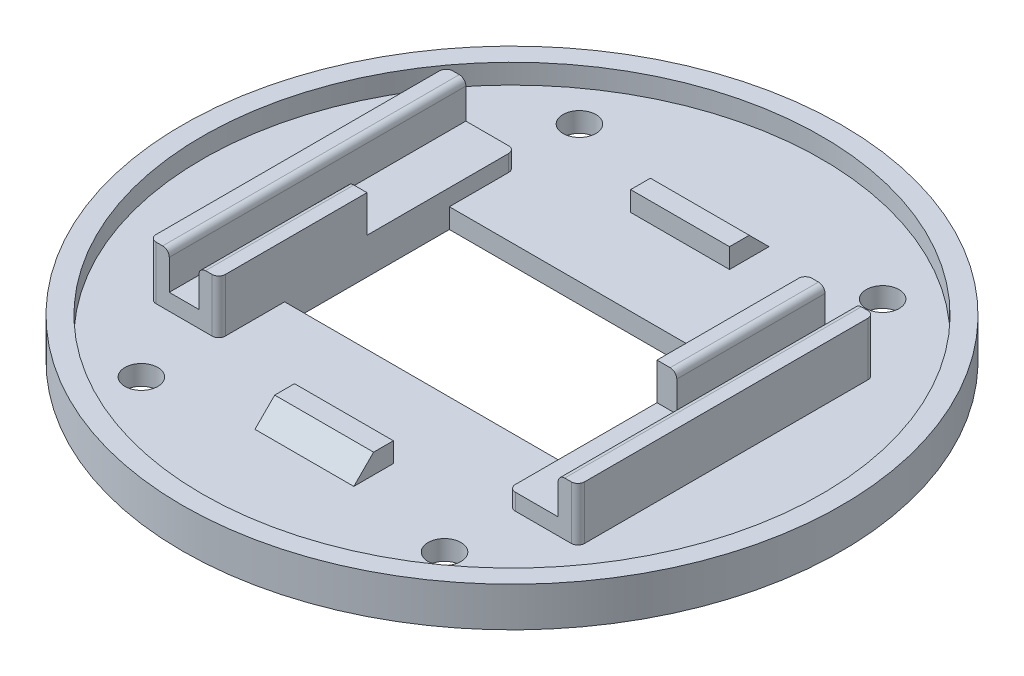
ISO-10303-21;
HEADER;
FILE_DESCRIPTION(('STEP AP214'),'2;1');
FILE_NAME('part.step','',(''),(''),'','','');
FILE_SCHEMA(('AUTOMOTIVE_DESIGN { 1 0 10303 214 1 1 1 1 }'));
ENDSEC;
DATA;
#1=APPLICATION_CONTEXT('core data for automotive mechanical design processes');
#2=APPLICATION_PROTOCOL_DEFINITION('international standard','automotive_design',2000,#1);
#3=PRODUCT_CONTEXT('',#1,'mechanical');
#4=PRODUCT('Part','Part','',(#3));
#5=PRODUCT_RELATED_PRODUCT_CATEGORY('part','',(#4));
#6=PRODUCT_DEFINITION_FORMATION('','',#4);
#7=PRODUCT_DEFINITION_CONTEXT('part definition',#1,'design');
#8=PRODUCT_DEFINITION('design','',#6,#7);
#9=PRODUCT_DEFINITION_SHAPE('','',#8);
#10=(LENGTH_UNIT() NAMED_UNIT(*) SI_UNIT(.MILLI.,.METRE.));
#11=(NAMED_UNIT(*) PLANE_ANGLE_UNIT() SI_UNIT($,.RADIAN.));
#12=(NAMED_UNIT(*) SI_UNIT($,.STERADIAN.) SOLID_ANGLE_UNIT());
#13=UNCERTAINTY_MEASURE_WITH_UNIT(LENGTH_MEASURE(1.E-05),#10,'distance_accuracy_value','');
#14=(GEOMETRIC_REPRESENTATION_CONTEXT(3) GLOBAL_UNCERTAINTY_ASSIGNED_CONTEXT((#13)) GLOBAL_UNIT_ASSIGNED_CONTEXT((#10,
#11,#12)) REPRESENTATION_CONTEXT('',''));
#15=CARTESIAN_POINT('',(0.,0.,0.));
#16=DIRECTION('',(0.,0.,1.));
#17=DIRECTION('',(1.,0.,0.));
#18=AXIS2_PLACEMENT_3D('',#15,#16,#17);
#19=CARTESIAN_POINT('',(0.,5.5,0.));
#20=DIRECTION('',(0.,-1.,0.));
#21=DIRECTION('',(0.,0.,-1.));
#22=AXIS2_PLACEMENT_3D('',#19,#20,#21);
#23=PLANE('',#22);
#24=DIRECTION('',(0.,0.,1.));
#25=VECTOR('',#24,1.);
#26=CARTESIAN_POINT('',(22.,5.5,-22.5));
#27=LINE('',#26,#25);
#28=CARTESIAN_POINT('',(22.,5.5,0.));
#29=VERTEX_POINT('',#28);
#30=CARTESIAN_POINT('',(22.,5.5,21.5));
#31=VERTEX_POINT('',#30);
#32=EDGE_CURVE('E459',#29,#31,#27,.T.);
#33=ORIENTED_EDGE('',*,*,#32,.T.);
#34=CARTESIAN_POINT('',(23.,5.5,21.5));
#35=DIRECTION('',(0.,-1.,0.));
#36=DIRECTION('',(0.,0.,-1.));
#37=AXIS2_PLACEMENT_3D('',#34,#35,#36);
#38=CIRCLE('',#37,1.);
#39=CARTESIAN_POINT('',(23.,5.5,22.5));
#40=VERTEX_POINT('',#39);
#41=EDGE_CURVE('E434',#31,#40,#38,.F.);
#42=ORIENTED_EDGE('',*,*,#41,.T.);
#43=DIRECTION('',(1.,0.,0.));
#44=VECTOR('',#43,1.);
#45=CARTESIAN_POINT('',(32.5,5.5,22.5));
#46=LINE('',#45,#44);
#47=CARTESIAN_POINT('',(29.5,5.5,22.5));
#48=VERTEX_POINT('',#47);
#49=EDGE_CURVE('E515',#40,#48,#46,.T.);
#50=ORIENTED_EDGE('',*,*,#49,.T.);
#51=DIRECTION('',(0.,0.,1.));
#52=VECTOR('',#51,1.);
#53=CARTESIAN_POINT('',(29.5,5.5,22.5));
#54=LINE('',#53,#52);
#55=CARTESIAN_POINT('',(29.5,5.5,-22.5));
#56=VERTEX_POINT('',#55);
#57=EDGE_CURVE('E341',#56,#48,#54,.T.);
#58=ORIENTED_EDGE('',*,*,#57,.F.);
#59=DIRECTION('',(-1.,0.,0.));
#60=VECTOR('',#59,1.);
#61=CARTESIAN_POINT('',(32.5,5.5,-22.5));
#62=LINE('',#61,#60);
#63=CARTESIAN_POINT('',(25.,5.5,-22.5));
#64=VERTEX_POINT('',#63);
#65=EDGE_CURVE('E385',#56,#64,#62,.T.);
#66=ORIENTED_EDGE('',*,*,#65,.T.);
#67=DIRECTION('',(0.,0.,-1.));
#68=VECTOR('',#67,1.);
#69=CARTESIAN_POINT('',(25.,5.5,0.));
#70=LINE('',#69,#68);
#71=CARTESIAN_POINT('',(25.,5.5,0.));
#72=VERTEX_POINT('',#71);
#73=EDGE_CURVE('E366',#72,#64,#70,.T.);
#74=ORIENTED_EDGE('',*,*,#73,.F.);
#75=DIRECTION('',(1.,0.,0.));
#76=VECTOR('',#75,1.);
#77=CARTESIAN_POINT('',(22.,5.5,0.));
#78=LINE('',#77,#76);
#79=EDGE_CURVE('E362',#29,#72,#78,.T.);
#80=ORIENTED_EDGE('',*,*,#79,.F.);
#81=EDGE_LOOP('',(#33,#42,#50,#58,#66,#74,#80));
#82=FACE_BOUND('',#81,.T.);
#83=ADVANCED_FACE('F33',(#82),#23,.F.);
#84=CARTESIAN_POINT('',(0.,5.5,0.));
#85=DIRECTION('',(0.,1.,0.));
#86=DIRECTION('',(0.,0.,1.));
#87=AXIS2_PLACEMENT_3D('',#84,#85,#86);
#88=PLANE('',#87);
#89=DIRECTION('',(0.,0.,-1.));
#90=VECTOR('',#89,1.);
#91=CARTESIAN_POINT('',(-22.,5.5,-22.5));
#92=LINE('',#91,#90);
#93=CARTESIAN_POINT('',(-22.,5.5,0.));
#94=VERTEX_POINT('',#93);
#95=CARTESIAN_POINT('',(-22.,5.5,-21.5));
#96=VERTEX_POINT('',#95);
#97=EDGE_CURVE('E542',#94,#96,#92,.T.);
#98=ORIENTED_EDGE('',*,*,#97,.T.);
#99=CARTESIAN_POINT('',(-23.,5.5,-21.5));
#100=DIRECTION('',(0.,1.,0.));
#101=DIRECTION('',(0.,0.,1.));
#102=AXIS2_PLACEMENT_3D('',#99,#100,#101);
#103=CIRCLE('',#102,1.);
#104=CARTESIAN_POINT('',(-23.,5.5,-22.5));
#105=VERTEX_POINT('',#104);
#106=EDGE_CURVE('E466',#96,#105,#103,.T.);
#107=ORIENTED_EDGE('',*,*,#106,.T.);
#108=DIRECTION('',(-1.,0.,0.));
#109=VECTOR('',#108,1.);
#110=CARTESIAN_POINT('',(-32.5,5.5,-22.5));
#111=LINE('',#110,#109);
#112=CARTESIAN_POINT('',(-29.5,5.5,-22.5));
#113=VERTEX_POINT('',#112);
#114=EDGE_CURVE('E448',#105,#113,#111,.T.);
#115=ORIENTED_EDGE('',*,*,#114,.T.);
#116=DIRECTION('',(0.,0.,-1.));
#117=VECTOR('',#116,1.);
#118=CARTESIAN_POINT('',(-29.5,5.5,-22.5));
#119=LINE('',#118,#117);
#120=CARTESIAN_POINT('',(-29.5,5.5,22.5));
#121=VERTEX_POINT('',#120);
#122=EDGE_CURVE('E454',#121,#113,#119,.T.);
#123=ORIENTED_EDGE('',*,*,#122,.F.);
#124=DIRECTION('',(1.,0.,0.));
#125=VECTOR('',#124,1.);
#126=CARTESIAN_POINT('',(-32.5,5.5,22.5));
#127=LINE('',#126,#125);
#128=CARTESIAN_POINT('',(-25.,5.5,22.5));
#129=VERTEX_POINT('',#128);
#130=EDGE_CURVE('E593',#121,#129,#127,.T.);
#131=ORIENTED_EDGE('',*,*,#130,.T.);
#132=DIRECTION('',(0.,0.,1.));
#133=VECTOR('',#132,1.);
#134=CARTESIAN_POINT('',(-25.,5.5,0.));
#135=LINE('',#134,#133);
#136=CARTESIAN_POINT('',(-25.,5.5,0.));
#137=VERTEX_POINT('',#136);
#138=EDGE_CURVE('E881',#137,#129,#135,.T.);
#139=ORIENTED_EDGE('',*,*,#138,.F.);
#140=DIRECTION('',(-1.,0.,0.));
#141=VECTOR('',#140,1.);
#142=CARTESIAN_POINT('',(-22.,5.5,0.));
#143=LINE('',#142,#141);
#144=EDGE_CURVE('E879',#94,#137,#143,.T.);
#145=ORIENTED_EDGE('',*,*,#144,.F.);
#146=EDGE_LOOP('',(#98,#107,#115,#123,#131,#139,#145));
#147=FACE_BOUND('',#146,.T.);
#148=ADVANCED_FACE('F540',(#147),#88,.T.);
#149=CARTESIAN_POINT('',(0.,3.,0.));
#150=DIRECTION('',(0.,1.,0.));
#151=DIRECTION('',(0.,0.,1.));
#152=AXIS2_PLACEMENT_3D('',#149,#150,#151);
#153=PLANE('',#152);
#154=DIRECTION('',(-1.,0.,0.));
#155=VECTOR('',#154,1.);
#156=CARTESIAN_POINT('',(-22.,3.,-12.5));
#157=LINE('',#156,#155);
#158=CARTESIAN_POINT('',(22.,3.,-12.5));
#159=VERTEX_POINT('',#158);
#160=CARTESIAN_POINT('',(-22.,3.,-12.5));
#161=VERTEX_POINT('',#160);
#162=EDGE_CURVE('E330',#159,#161,#157,.T.);
#163=ORIENTED_EDGE('',*,*,#162,.F.);
#164=DIRECTION('',(0.,0.,1.));
#165=VECTOR('',#164,1.);
#166=CARTESIAN_POINT('',(22.,3.,-22.5));
#167=LINE('',#166,#165);
#168=CARTESIAN_POINT('',(22.,3.,-21.5));
#169=VERTEX_POINT('',#168);
#170=EDGE_CURVE('E586',#169,#159,#167,.T.);
#171=ORIENTED_EDGE('',*,*,#170,.F.);
#172=CARTESIAN_POINT('',(23.,3.,-21.5));
#173=DIRECTION('',(0.,1.,0.));
#174=DIRECTION('',(0.,0.,1.));
#175=AXIS2_PLACEMENT_3D('',#172,#173,#174);
#176=CIRCLE('',#175,1.);
#177=CARTESIAN_POINT('',(23.,3.,-22.5));
#178=VERTEX_POINT('',#177);
#179=EDGE_CURVE('E488',#169,#178,#176,.F.);
#180=ORIENTED_EDGE('',*,*,#179,.T.);
#181=DIRECTION('',(-1.,0.,0.));
#182=VECTOR('',#181,1.);
#183=CARTESIAN_POINT('',(32.5,3.,-22.5));
#184=LINE('',#183,#182);
#185=CARTESIAN_POINT('',(31.5,3.,-22.5));
#186=VERTEX_POINT('',#185);
#187=EDGE_CURVE('E582',#186,#178,#184,.T.);
#188=ORIENTED_EDGE('',*,*,#187,.F.);
#189=CARTESIAN_POINT('',(31.5,3.,-21.5));
#190=DIRECTION('',(0.,1.,0.));
#191=DIRECTION('',(0.,0.,1.));
#192=AXIS2_PLACEMENT_3D('',#189,#190,#191);
#193=CIRCLE('',#192,1.);
#194=CARTESIAN_POINT('',(32.5,3.,-21.5));
#195=VERTEX_POINT('',#194);
#196=EDGE_CURVE('E486',#186,#195,#193,.F.);
#197=ORIENTED_EDGE('',*,*,#196,.T.);
#198=DIRECTION('',(0.,0.,-1.));
#199=VECTOR('',#198,1.);
#200=CARTESIAN_POINT('',(32.5,3.,-22.5));
#201=LINE('',#200,#199);
#202=CARTESIAN_POINT('',(32.5,3.,21.5));
#203=VERTEX_POINT('',#202);
#204=EDGE_CURVE('E465',#203,#195,#201,.T.);
#205=ORIENTED_EDGE('',*,*,#204,.F.);
#206=CARTESIAN_POINT('',(31.5,3.,21.5));
#207=DIRECTION('',(0.,1.,0.));
#208=DIRECTION('',(0.,0.,1.));
#209=AXIS2_PLACEMENT_3D('',#206,#207,#208);
#210=CIRCLE('',#209,1.);
#211=CARTESIAN_POINT('',(31.5,3.,22.5));
#212=VERTEX_POINT('',#211);
#213=EDGE_CURVE('E490',#203,#212,#210,.F.);
#214=ORIENTED_EDGE('',*,*,#213,.T.);
#215=DIRECTION('',(1.,0.,0.));
#216=VECTOR('',#215,1.);
#217=CARTESIAN_POINT('',(32.5,3.,22.5));
#218=LINE('',#217,#216);
#219=CARTESIAN_POINT('',(23.,3.,22.5));
#220=VERTEX_POINT('',#219);
#221=EDGE_CURVE('E588',#220,#212,#218,.T.);
#222=ORIENTED_EDGE('',*,*,#221,.F.);
#223=CARTESIAN_POINT('',(23.,3.,21.5));
#224=DIRECTION('',(0.,1.,0.));
#225=DIRECTION('',(0.,0.,1.));
#226=AXIS2_PLACEMENT_3D('',#223,#224,#225);
#227=CIRCLE('',#226,1.);
#228=CARTESIAN_POINT('',(22.,3.,21.5));
#229=VERTEX_POINT('',#228);
#230=EDGE_CURVE('E492',#220,#229,#227,.F.);
#231=ORIENTED_EDGE('',*,*,#230,.T.);
#232=CARTESIAN_POINT('',(22.,3.,12.5));
#233=VERTEX_POINT('',#232);
#234=EDGE_CURVE('E585',#233,#229,#167,.T.);
#235=ORIENTED_EDGE('',*,*,#234,.F.);
#236=DIRECTION('',(1.,0.,0.));
#237=VECTOR('',#236,1.);
#238=CARTESIAN_POINT('',(-22.,3.,12.5));
#239=LINE('',#238,#237);
#240=CARTESIAN_POINT('',(-22.,3.,12.5));
#241=VERTEX_POINT('',#240);
#242=EDGE_CURVE('E333',#241,#233,#239,.T.);
#243=ORIENTED_EDGE('',*,*,#242,.F.);
#244=DIRECTION('',(0.,0.,-1.));
#245=VECTOR('',#244,1.);
#246=CARTESIAN_POINT('',(-22.,3.,-22.5));
#247=LINE('',#246,#245);
#248=CARTESIAN_POINT('',(-22.,3.,21.5));
#249=VERTEX_POINT('',#248);
#250=EDGE_CURVE('E312',#249,#241,#247,.T.);
#251=ORIENTED_EDGE('',*,*,#250,.F.);
#252=CARTESIAN_POINT('',(-23.,3.,21.5));
#253=DIRECTION('',(0.,1.,0.));
#254=DIRECTION('',(0.,0.,1.));
#255=AXIS2_PLACEMENT_3D('',#252,#253,#254);
#256=CIRCLE('',#255,1.);
#257=CARTESIAN_POINT('',(-23.,3.,22.5));
#258=VERTEX_POINT('',#257);
#259=EDGE_CURVE('E11',#249,#258,#256,.F.);
#260=ORIENTED_EDGE('',*,*,#259,.T.);
#261=DIRECTION('',(1.,0.,0.));
#262=VECTOR('',#261,1.);
#263=CARTESIAN_POINT('',(-32.5,3.,22.5));
#264=LINE('',#263,#262);
#265=CARTESIAN_POINT('',(-31.5,3.,22.5));
#266=VERTEX_POINT('',#265);
#267=EDGE_CURVE('E506',#266,#258,#264,.T.);
#268=ORIENTED_EDGE('',*,*,#267,.F.);
#269=CARTESIAN_POINT('',(-31.5,3.,21.5));
#270=DIRECTION('',(0.,1.,0.));
#271=DIRECTION('',(0.,0.,1.));
#272=AXIS2_PLACEMENT_3D('',#269,#270,#271);
#273=CIRCLE('',#272,1.);
#274=CARTESIAN_POINT('',(-32.5,3.,21.5));
#275=VERTEX_POINT('',#274);
#276=EDGE_CURVE('E41',#266,#275,#273,.F.);
#277=ORIENTED_EDGE('',*,*,#276,.T.);
#278=DIRECTION('',(0.,0.,1.));
#279=VECTOR('',#278,1.);
#280=CARTESIAN_POINT('',(-32.5,3.,-22.5));
#281=LINE('',#280,#279);
#282=CARTESIAN_POINT('',(-32.5,3.,-21.5));
#283=VERTEX_POINT('',#282);
#284=EDGE_CURVE('E504',#283,#275,#281,.T.);
#285=ORIENTED_EDGE('',*,*,#284,.F.);
#286=CARTESIAN_POINT('',(-31.5,3.,-21.5));
#287=DIRECTION('',(0.,1.,0.));
#288=DIRECTION('',(0.,0.,1.));
#289=AXIS2_PLACEMENT_3D('',#286,#287,#288);
#290=CIRCLE('',#289,1.);
#291=CARTESIAN_POINT('',(-31.5,3.,-22.5));
#292=VERTEX_POINT('',#291);
#293=EDGE_CURVE('E494',#283,#292,#290,.F.);
#294=ORIENTED_EDGE('',*,*,#293,.T.);
#295=DIRECTION('',(-1.,0.,0.));
#296=VECTOR('',#295,1.);
#297=CARTESIAN_POINT('',(-32.5,3.,-22.5));
#298=LINE('',#297,#296);
#299=CARTESIAN_POINT('',(-23.,3.,-22.5));
#300=VERTEX_POINT('',#299);
#301=EDGE_CURVE('E596',#300,#292,#298,.T.);
#302=ORIENTED_EDGE('',*,*,#301,.F.);
#303=CARTESIAN_POINT('',(-23.,3.,-21.5));
#304=DIRECTION('',(0.,1.,0.));
#305=DIRECTION('',(0.,0.,1.));
#306=AXIS2_PLACEMENT_3D('',#303,#304,#305);
#307=CIRCLE('',#306,1.);
#308=CARTESIAN_POINT('',(-22.,3.,-21.5));
#309=VERTEX_POINT('',#308);
#310=EDGE_CURVE('E496',#300,#309,#307,.F.);
#311=ORIENTED_EDGE('',*,*,#310,.T.);
#312=EDGE_CURVE('E694',#161,#309,#247,.T.);
#313=ORIENTED_EDGE('',*,*,#312,.F.);
#314=EDGE_LOOP('',(#163,#171,#180,#188,#197,#205,#214,#222,#231,#235,#243,#251,#260,#268,#277,
#285,#294,#302,#311,#313));
#315=FACE_BOUND('',#314,.T.);
#316=DIRECTION('',(0.,0.,1.));
#317=VECTOR('',#316,1.);
#318=CARTESIAN_POINT('',(-7.5,3.,-28.5));
#319=LINE('',#318,#317);
#320=CARTESIAN_POINT('',(-7.5,3.,-31.5));
#321=VERTEX_POINT('',#320);
#322=CARTESIAN_POINT('',(-7.5,3.,-25.5));
#323=VERTEX_POINT('',#322);
#324=EDGE_CURVE('E659',#321,#323,#319,.T.);
#325=ORIENTED_EDGE('',*,*,#324,.F.);
#326=DIRECTION('',(1.,0.,0.));
#327=VECTOR('',#326,1.);
#328=CARTESIAN_POINT('',(0.,3.,-31.5));
#329=LINE('',#328,#327);
#330=CARTESIAN_POINT('',(7.49999999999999,3.,-31.5));
#331=VERTEX_POINT('',#330);
#332=EDGE_CURVE('E606',#321,#331,#329,.T.);
#333=ORIENTED_EDGE('',*,*,#332,.T.);
#334=DIRECTION('',(0.,0.,-1.));
#335=VECTOR('',#334,1.);
#336=CARTESIAN_POINT('',(7.5,3.,-28.5));
#337=LINE('',#336,#335);
#338=CARTESIAN_POINT('',(7.50000000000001,3.,-25.5));
#339=VERTEX_POINT('',#338);
#340=EDGE_CURVE('E654',#339,#331,#337,.T.);
#341=ORIENTED_EDGE('',*,*,#340,.F.);
#342=DIRECTION('',(1.,0.,0.));
#343=VECTOR('',#342,1.);
#344=CARTESIAN_POINT('',(-7.5,3.,-25.5));
#345=LINE('',#344,#343);
#346=EDGE_CURVE('E657',#323,#339,#345,.T.);
#347=ORIENTED_EDGE('',*,*,#346,.F.);
#348=EDGE_LOOP('',(#325,#333,#341,#347));
#349=FACE_BOUND('',#348,.T.);
#350=CARTESIAN_POINT('',(0.,3.,0.));
#351=DIRECTION('',(0.,1.,0.));
#352=DIRECTION('',(0.,0.,1.));
#353=AXIS2_PLACEMENT_3D('',#350,#351,#352);
#354=CIRCLE('',#353,47.);
#355=CARTESIAN_POINT('',(0.,3.,47.));
#356=VERTEX_POINT('',#355);
#357=EDGE_CURVE('E612',#356,#356,#354,.F.);
#358=ORIENTED_EDGE('',*,*,#357,.F.);
#359=EDGE_LOOP('',(#358));
#360=FACE_BOUND('',#359,.T.);
#361=CARTESIAN_POINT('',(-23.,3.,33.2340187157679));
#362=DIRECTION('',(0.,1.,0.));
#363=DIRECTION('',(0.,0.,-1.));
#364=AXIS2_PLACEMENT_3D('',#361,#362,#363);
#365=CIRCLE('',#364,2.5);
#366=CARTESIAN_POINT('',(-23.,3.,30.7340187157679));
#367=VERTEX_POINT('',#366);
#368=EDGE_CURVE('E637',#367,#367,#365,.T.);
#369=ORIENTED_EDGE('',*,*,#368,.F.);
#370=EDGE_LOOP('',(#369));
#371=FACE_BOUND('',#370,.T.);
#372=CARTESIAN_POINT('',(23.,3.,33.2340187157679));
#373=DIRECTION('',(0.,1.,0.));
#374=DIRECTION('',(0.,0.,1.));
#375=AXIS2_PLACEMENT_3D('',#372,#373,#374);
#376=CIRCLE('',#375,2.5);
#377=CARTESIAN_POINT('',(23.,3.,35.7340187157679));
#378=VERTEX_POINT('',#377);
#379=EDGE_CURVE('E631',#378,#378,#376,.T.);
#380=ORIENTED_EDGE('',*,*,#379,.F.);
#381=EDGE_LOOP('',(#380));
#382=FACE_BOUND('',#381,.T.);
#383=CARTESIAN_POINT('',(23.,3.,-33.2340187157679));
#384=DIRECTION('',(0.,1.,0.));
#385=DIRECTION('',(0.,0.,-1.));
#386=AXIS2_PLACEMENT_3D('',#383,#384,#385);
#387=CIRCLE('',#386,2.5);
#388=CARTESIAN_POINT('',(23.,3.,-35.7340187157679));
#389=VERTEX_POINT('',#388);
#390=EDGE_CURVE('E625',#389,#389,#387,.T.);
#391=ORIENTED_EDGE('',*,*,#390,.F.);
#392=EDGE_LOOP('',(#391));
#393=FACE_BOUND('',#392,.T.);
#394=CARTESIAN_POINT('',(-23.,3.,-33.2340187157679));
#395=DIRECTION('',(0.,1.,0.));
#396=DIRECTION('',(0.,0.,1.));
#397=AXIS2_PLACEMENT_3D('',#394,#395,#396);
#398=CIRCLE('',#397,2.5);
#399=CARTESIAN_POINT('',(-23.,3.,-30.7340187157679));
#400=VERTEX_POINT('',#399);
#401=EDGE_CURVE('E619',#400,#400,#398,.T.);
#402=ORIENTED_EDGE('',*,*,#401,.F.);
#403=EDGE_LOOP('',(#402));
#404=FACE_BOUND('',#403,.T.);
#405=DIRECTION('',(0.,0.,-1.));
#406=VECTOR('',#405,1.);
#407=CARTESIAN_POINT('',(7.5,3.,28.5));
#408=LINE('',#407,#406);
#409=CARTESIAN_POINT('',(7.49999999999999,3.,31.5));
#410=VERTEX_POINT('',#409);
#411=CARTESIAN_POINT('',(7.50000000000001,3.,25.5));
#412=VERTEX_POINT('',#411);
#413=EDGE_CURVE('E553',#410,#412,#408,.T.);
#414=ORIENTED_EDGE('',*,*,#413,.F.);
#415=DIRECTION('',(-1.,0.,0.));
#416=VECTOR('',#415,1.);
#417=CARTESIAN_POINT('',(0.,3.,31.5));
#418=LINE('',#417,#416);
#419=CARTESIAN_POINT('',(-7.5,3.,31.5));
#420=VERTEX_POINT('',#419);
#421=EDGE_CURVE('E609',#410,#420,#418,.T.);
#422=ORIENTED_EDGE('',*,*,#421,.T.);
#423=DIRECTION('',(0.,0.,1.));
#424=VECTOR('',#423,1.);
#425=CARTESIAN_POINT('',(-7.5,3.,28.5));
#426=LINE('',#425,#424);
#427=CARTESIAN_POINT('',(-7.5,3.,25.5));
#428=VERTEX_POINT('',#427);
#429=EDGE_CURVE('E677',#428,#420,#426,.T.);
#430=ORIENTED_EDGE('',*,*,#429,.F.);
#431=DIRECTION('',(-1.,0.,0.));
#432=VECTOR('',#431,1.);
#433=CARTESIAN_POINT('',(-7.5,3.,25.5));
#434=LINE('',#433,#432);
#435=EDGE_CURVE('E680',#412,#428,#434,.T.);
#436=ORIENTED_EDGE('',*,*,#435,.F.);
#437=EDGE_LOOP('',(#414,#422,#430,#436));
#438=FACE_BOUND('',#437,.T.);
#439=ADVANCED_FACE('F502',(#315,#349,#360,#371,#382,#393,#404,#438),#153,.T.);
#440=CARTESIAN_POINT('',(0.,3.,0.));
#441=DIRECTION('',(0.,-1.,0.));
#442=DIRECTION('',(0.,0.,-1.));
#443=AXIS2_PLACEMENT_3D('',#440,#441,#442);
#444=CYLINDRICAL_SURFACE('',#443,50.);
#445=CARTESIAN_POINT('',(0.,0.,0.));
#446=DIRECTION('',(0.,1.,0.));
#447=DIRECTION('',(0.,0.,1.));
#448=AXIS2_PLACEMENT_3D('',#445,#446,#447);
#449=CIRCLE('',#448,50.);
#450=CARTESIAN_POINT('',(0.,0.,50.));
#451=VERTEX_POINT('',#450);
#452=EDGE_CURVE('E615',#451,#451,#449,.T.);
#453=ORIENTED_EDGE('',*,*,#452,.T.);
#454=EDGE_LOOP('',(#453));
#455=FACE_BOUND('',#454,.T.);
#456=CARTESIAN_POINT('',(0.,6.,0.));
#457=DIRECTION('',(0.,1.,0.));
#458=DIRECTION('',(0.,0.,1.));
#459=AXIS2_PLACEMENT_3D('',#456,#457,#458);
#460=CIRCLE('',#459,50.);
#461=CARTESIAN_POINT('',(0.,6.,50.));
#462=VERTEX_POINT('',#461);
#463=EDGE_CURVE('E640',#462,#462,#460,.T.);
#464=ORIENTED_EDGE('',*,*,#463,.F.);
#465=EDGE_LOOP('',(#464));
#466=FACE_BOUND('',#465,.T.);
#467=ADVANCED_FACE('F809',(#455,#466),#444,.T.);
#468=CARTESIAN_POINT('',(0.,0.,0.));
#469=DIRECTION('',(0.,1.,0.));
#470=DIRECTION('',(0.,0.,1.));
#471=AXIS2_PLACEMENT_3D('',#468,#469,#470);
#472=PLANE('',#471);
#473=DIRECTION('',(-1.,0.,0.));
#474=VECTOR('',#473,1.);
#475=CARTESIAN_POINT('',(-22.,0.,-12.5));
#476=LINE('',#475,#474);
#477=CARTESIAN_POINT('',(22.,0.,-12.5));
#478=VERTEX_POINT('',#477);
#479=CARTESIAN_POINT('',(-22.,0.,-12.5));
#480=VERTEX_POINT('',#479);
#481=EDGE_CURVE('E316',#478,#480,#476,.T.);
#482=ORIENTED_EDGE('',*,*,#481,.T.);
#483=DIRECTION('',(0.,0.,1.));
#484=VECTOR('',#483,1.);
#485=CARTESIAN_POINT('',(-22.,0.,-12.5));
#486=LINE('',#485,#484);
#487=CARTESIAN_POINT('',(-22.,0.,12.5));
#488=VERTEX_POINT('',#487);
#489=EDGE_CURVE('E308',#480,#488,#486,.T.);
#490=ORIENTED_EDGE('',*,*,#489,.T.);
#491=DIRECTION('',(1.,0.,0.));
#492=VECTOR('',#491,1.);
#493=CARTESIAN_POINT('',(-22.,0.,12.5));
#494=LINE('',#493,#492);
#495=CARTESIAN_POINT('',(22.,0.,12.5));
#496=VERTEX_POINT('',#495);
#497=EDGE_CURVE('E320',#488,#496,#494,.T.);
#498=ORIENTED_EDGE('',*,*,#497,.T.);
#499=DIRECTION('',(0.,0.,-1.));
#500=VECTOR('',#499,1.);
#501=CARTESIAN_POINT('',(22.,0.,-12.5));
#502=LINE('',#501,#500);
#503=EDGE_CURVE('E325',#496,#478,#502,.T.);
#504=ORIENTED_EDGE('',*,*,#503,.T.);
#505=EDGE_LOOP('',(#482,#490,#498,#504));
#506=FACE_BOUND('',#505,.T.);
#507=CARTESIAN_POINT('',(-23.,0.,33.2340187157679));
#508=DIRECTION('',(0.,1.,0.));
#509=DIRECTION('',(0.,0.,-1.));
#510=AXIS2_PLACEMENT_3D('',#507,#508,#509);
#511=CIRCLE('',#510,2.5);
#512=CARTESIAN_POINT('',(-23.,0.,30.7340187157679));
#513=VERTEX_POINT('',#512);
#514=EDGE_CURVE('E634',#513,#513,#511,.T.);
#515=ORIENTED_EDGE('',*,*,#514,.T.);
#516=EDGE_LOOP('',(#515));
#517=FACE_BOUND('',#516,.T.);
#518=CARTESIAN_POINT('',(23.,0.,33.2340187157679));
#519=DIRECTION('',(0.,1.,0.));
#520=DIRECTION('',(0.,0.,1.));
#521=AXIS2_PLACEMENT_3D('',#518,#519,#520);
#522=CIRCLE('',#521,2.5);
#523=CARTESIAN_POINT('',(23.,0.,35.7340187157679));
#524=VERTEX_POINT('',#523);
#525=EDGE_CURVE('E628',#524,#524,#522,.T.);
#526=ORIENTED_EDGE('',*,*,#525,.T.);
#527=EDGE_LOOP('',(#526));
#528=FACE_BOUND('',#527,.T.);
#529=CARTESIAN_POINT('',(23.,0.,-33.2340187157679));
#530=DIRECTION('',(0.,1.,0.));
#531=DIRECTION('',(0.,0.,-1.));
#532=AXIS2_PLACEMENT_3D('',#529,#530,#531);
#533=CIRCLE('',#532,2.5);
#534=CARTESIAN_POINT('',(23.,0.,-35.7340187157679));
#535=VERTEX_POINT('',#534);
#536=EDGE_CURVE('E622',#535,#535,#533,.T.);
#537=ORIENTED_EDGE('',*,*,#536,.T.);
#538=EDGE_LOOP('',(#537));
#539=FACE_BOUND('',#538,.T.);
#540=CARTESIAN_POINT('',(-23.,0.,-33.2340187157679));
#541=DIRECTION('',(0.,1.,0.));
#542=DIRECTION('',(0.,0.,1.));
#543=AXIS2_PLACEMENT_3D('',#540,#541,#542);
#544=CIRCLE('',#543,2.5);
#545=CARTESIAN_POINT('',(-23.,0.,-30.7340187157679));
#546=VERTEX_POINT('',#545);
#547=EDGE_CURVE('E618',#546,#546,#544,.T.);
#548=ORIENTED_EDGE('',*,*,#547,.T.);
#549=EDGE_LOOP('',(#548));
#550=FACE_BOUND('',#549,.T.);
#551=ORIENTED_EDGE('',*,*,#452,.F.);
#552=EDGE_LOOP('',(#551));
#553=FACE_BOUND('',#552,.T.);
#554=ADVANCED_FACE('F327',(#506,#517,#528,#539,#550,#553),#472,.F.);
#555=CARTESIAN_POINT('',(-23.,0.,-33.2340187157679));
#556=DIRECTION('',(0.,1.,0.));
#557=DIRECTION('',(0.,0.,1.));
#558=AXIS2_PLACEMENT_3D('',#555,#556,#557);
#559=CYLINDRICAL_SURFACE('',#558,2.5);
#560=ORIENTED_EDGE('',*,*,#547,.F.);
#561=EDGE_LOOP('',(#560));
#562=FACE_BOUND('',#561,.T.);
#563=ORIENTED_EDGE('',*,*,#401,.T.);
#564=EDGE_LOOP('',(#563));
#565=FACE_BOUND('',#564,.T.);
#566=ADVANCED_FACE('F802',(#562,#565),#559,.F.);
#567=CARTESIAN_POINT('',(23.,0.,-33.2340187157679));
#568=DIRECTION('',(0.,1.,0.));
#569=DIRECTION('',(0.,0.,1.));
#570=AXIS2_PLACEMENT_3D('',#567,#568,#569);
#571=CYLINDRICAL_SURFACE('',#570,2.5);
#572=ORIENTED_EDGE('',*,*,#536,.F.);
#573=EDGE_LOOP('',(#572));
#574=FACE_BOUND('',#573,.T.);
#575=ORIENTED_EDGE('',*,*,#390,.T.);
#576=EDGE_LOOP('',(#575));
#577=FACE_BOUND('',#576,.T.);
#578=ADVANCED_FACE('F798',(#574,#577),#571,.F.);
#579=CARTESIAN_POINT('',(23.,0.,33.2340187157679));
#580=DIRECTION('',(0.,1.,0.));
#581=DIRECTION('',(0.,0.,1.));
#582=AXIS2_PLACEMENT_3D('',#579,#580,#581);
#583=CYLINDRICAL_SURFACE('',#582,2.5);
#584=ORIENTED_EDGE('',*,*,#525,.F.);
#585=EDGE_LOOP('',(#584));
#586=FACE_BOUND('',#585,.T.);
#587=ORIENTED_EDGE('',*,*,#379,.T.);
#588=EDGE_LOOP('',(#587));
#589=FACE_BOUND('',#588,.T.);
#590=ADVANCED_FACE('F794',(#586,#589),#583,.F.);
#591=CARTESIAN_POINT('',(-23.,0.,33.2340187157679));
#592=DIRECTION('',(0.,1.,0.));
#593=DIRECTION('',(0.,0.,1.));
#594=AXIS2_PLACEMENT_3D('',#591,#592,#593);
#595=CYLINDRICAL_SURFACE('',#594,2.5);
#596=ORIENTED_EDGE('',*,*,#514,.F.);
#597=EDGE_LOOP('',(#596));
#598=FACE_BOUND('',#597,.T.);
#599=ORIENTED_EDGE('',*,*,#368,.T.);
#600=EDGE_LOOP('',(#599));
#601=FACE_BOUND('',#600,.T.);
#602=ADVANCED_FACE('F790',(#598,#601),#595,.F.);
#603=CARTESIAN_POINT('',(0.,6.,0.));
#604=DIRECTION('',(0.,1.,0.));
#605=DIRECTION('',(0.,0.,1.));
#606=AXIS2_PLACEMENT_3D('',#603,#604,#605);
#607=PLANE('',#606);
#608=ORIENTED_EDGE('',*,*,#463,.T.);
#609=EDGE_LOOP('',(#608));
#610=FACE_BOUND('',#609,.T.);
#611=CARTESIAN_POINT('',(0.,6.,0.));
#612=DIRECTION('',(0.,1.,0.));
#613=DIRECTION('',(0.,0.,1.));
#614=AXIS2_PLACEMENT_3D('',#611,#612,#613);
#615=CIRCLE('',#614,47.);
#616=CARTESIAN_POINT('',(0.,6.,47.));
#617=VERTEX_POINT('',#616);
#618=EDGE_CURVE('E645',#617,#617,#615,.T.);
#619=ORIENTED_EDGE('',*,*,#618,.F.);
#620=EDGE_LOOP('',(#619));
#621=FACE_BOUND('',#620,.T.);
#622=ADVANCED_FACE('F786',(#610,#621),#607,.T.);
#623=CARTESIAN_POINT('',(0.,6.,0.));
#624=DIRECTION('',(0.,-1.,0.));
#625=DIRECTION('',(0.,0.,-1.));
#626=AXIS2_PLACEMENT_3D('',#623,#624,#625);
#627=CYLINDRICAL_SURFACE('',#626,47.);
#628=ORIENTED_EDGE('',*,*,#618,.T.);
#629=EDGE_LOOP('',(#628));
#630=FACE_BOUND('',#629,.T.);
#631=ORIENTED_EDGE('',*,*,#357,.T.);
#632=EDGE_LOOP('',(#631));
#633=FACE_BOUND('',#632,.T.);
#634=ADVANCED_FACE('F782',(#630,#633),#627,.F.);
#635=CARTESIAN_POINT('',(-7.5,6.,-28.5));
#636=DIRECTION('',(1.,0.,0.));
#637=DIRECTION('',(0.,0.,-1.));
#638=AXIS2_PLACEMENT_3D('',#635,#636,#637);
#639=PLANE('',#638);
#640=ORIENTED_EDGE('',*,*,#324,.T.);
#641=DIRECTION('',(0.,-1.,0.));
#642=VECTOR('',#641,1.);
#643=CARTESIAN_POINT('',(-7.5,6.,-25.5));
#644=LINE('',#643,#642);
#645=CARTESIAN_POINT('',(-7.5,6.,-25.5));
#646=VERTEX_POINT('',#645);
#647=EDGE_CURVE('E648',#646,#323,#644,.T.);
#648=ORIENTED_EDGE('',*,*,#647,.F.);
#649=DIRECTION('',(0.,0.,1.));
#650=VECTOR('',#649,1.);
#651=CARTESIAN_POINT('',(-7.5,6.,-28.5));
#652=LINE('',#651,#650);
#653=CARTESIAN_POINT('',(-7.5,6.,-28.5));
#654=VERTEX_POINT('',#653);
#655=EDGE_CURVE('E656',#654,#646,#652,.T.);
#656=ORIENTED_EDGE('',*,*,#655,.F.);
#657=DIRECTION('',(0.,-0.707106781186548,-0.707106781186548));
#658=VECTOR('',#657,1.);
#659=CARTESIAN_POINT('',(-7.5,5.99999999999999,-28.5));
#660=LINE('',#659,#658);
#661=EDGE_CURVE('E603',#654,#321,#660,.T.);
#662=ORIENTED_EDGE('',*,*,#661,.T.);
#663=EDGE_LOOP('',(#640,#648,#656,#662));
#664=FACE_BOUND('',#663,.T.);
#665=ADVANCED_FACE('F778',(#664),#639,.F.);
#666=CARTESIAN_POINT('',(-7.5,6.,-25.5));
#667=DIRECTION('',(0.,0.,-1.));
#668=DIRECTION('',(-1.,0.,0.));
#669=AXIS2_PLACEMENT_3D('',#666,#667,#668);
#670=PLANE('',#669);
#671=ORIENTED_EDGE('',*,*,#346,.T.);
#672=DIRECTION('',(0.,-1.,0.));
#673=VECTOR('',#672,1.);
#674=CARTESIAN_POINT('',(7.50000000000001,6.,-25.5));
#675=LINE('',#674,#673);
#676=CARTESIAN_POINT('',(7.50000000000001,6.,-25.5));
#677=VERTEX_POINT('',#676);
#678=EDGE_CURVE('E650',#677,#339,#675,.T.);
#679=ORIENTED_EDGE('',*,*,#678,.F.);
#680=DIRECTION('',(1.,0.,0.));
#681=VECTOR('',#680,1.);
#682=CARTESIAN_POINT('',(-7.5,6.,-25.5));
#683=LINE('',#682,#681);
#684=EDGE_CURVE('E668',#646,#677,#683,.T.);
#685=ORIENTED_EDGE('',*,*,#684,.F.);
#686=ORIENTED_EDGE('',*,*,#647,.T.);
#687=EDGE_LOOP('',(#671,#679,#685,#686));
#688=FACE_BOUND('',#687,.T.);
#689=ADVANCED_FACE('F774',(#688),#670,.F.);
#690=CARTESIAN_POINT('',(7.5,6.,-28.5));
#691=DIRECTION('',(-1.,0.,0.));
#692=DIRECTION('',(0.,0.,1.));
#693=AXIS2_PLACEMENT_3D('',#690,#691,#692);
#694=PLANE('',#693);
#695=ORIENTED_EDGE('',*,*,#340,.T.);
#696=DIRECTION('',(0.,0.707106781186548,0.707106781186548));
#697=VECTOR('',#696,1.);
#698=CARTESIAN_POINT('',(7.5,5.99999999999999,-28.5));
#699=LINE('',#698,#697);
#700=CARTESIAN_POINT('',(7.5,6.,-28.5));
#701=VERTEX_POINT('',#700);
#702=EDGE_CURVE('E601',#331,#701,#699,.T.);
#703=ORIENTED_EDGE('',*,*,#702,.T.);
#704=DIRECTION('',(0.,0.,-1.));
#705=VECTOR('',#704,1.);
#706=CARTESIAN_POINT('',(7.5,6.,-28.5));
#707=LINE('',#706,#705);
#708=EDGE_CURVE('E665',#677,#701,#707,.T.);
#709=ORIENTED_EDGE('',*,*,#708,.F.);
#710=ORIENTED_EDGE('',*,*,#678,.T.);
#711=EDGE_LOOP('',(#695,#703,#709,#710));
#712=FACE_BOUND('',#711,.T.);
#713=ADVANCED_FACE('F770',(#712),#694,.F.);
#714=CARTESIAN_POINT('',(0.,6.,0.));
#715=DIRECTION('',(0.,1.,0.));
#716=DIRECTION('',(0.,0.,1.));
#717=AXIS2_PLACEMENT_3D('',#714,#715,#716);
#718=PLANE('',#717);
#719=ORIENTED_EDGE('',*,*,#655,.T.);
#720=ORIENTED_EDGE('',*,*,#684,.T.);
#721=ORIENTED_EDGE('',*,*,#708,.T.);
#722=DIRECTION('',(-1.,0.,0.));
#723=VECTOR('',#722,1.);
#724=CARTESIAN_POINT('',(-7.5,6.,-28.5));
#725=LINE('',#724,#723);
#726=EDGE_CURVE('E653',#701,#654,#725,.T.);
#727=ORIENTED_EDGE('',*,*,#726,.T.);
#728=EDGE_LOOP('',(#719,#720,#721,#727));
#729=FACE_BOUND('',#728,.T.);
#730=ADVANCED_FACE('F766',(#729),#718,.T.);
#731=CARTESIAN_POINT('',(7.5,6.,28.5));
#732=DIRECTION('',(-1.,0.,0.));
#733=DIRECTION('',(0.,0.,1.));
#734=AXIS2_PLACEMENT_3D('',#731,#732,#733);
#735=PLANE('',#734);
#736=ORIENTED_EDGE('',*,*,#413,.T.);
#737=DIRECTION('',(0.,-1.,0.));
#738=VECTOR('',#737,1.);
#739=CARTESIAN_POINT('',(7.50000000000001,6.,25.5));
#740=LINE('',#739,#738);
#741=CARTESIAN_POINT('',(7.50000000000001,6.,25.5));
#742=VERTEX_POINT('',#741);
#743=EDGE_CURVE('E662',#742,#412,#740,.T.);
#744=ORIENTED_EDGE('',*,*,#743,.F.);
#745=DIRECTION('',(0.,0.,-1.));
#746=VECTOR('',#745,1.);
#747=CARTESIAN_POINT('',(7.5,6.,28.5));
#748=LINE('',#747,#746);
#749=CARTESIAN_POINT('',(7.5,6.,28.5));
#750=VERTEX_POINT('',#749);
#751=EDGE_CURVE('E688',#750,#742,#748,.T.);
#752=ORIENTED_EDGE('',*,*,#751,.F.);
#753=DIRECTION('',(0.,-0.707106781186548,0.707106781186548));
#754=VECTOR('',#753,1.);
#755=CARTESIAN_POINT('',(7.5,5.99999999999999,28.5));
#756=LINE('',#755,#754);
#757=EDGE_CURVE('E598',#750,#410,#756,.T.);
#758=ORIENTED_EDGE('',*,*,#757,.T.);
#759=EDGE_LOOP('',(#736,#744,#752,#758));
#760=FACE_BOUND('',#759,.T.);
#761=ADVANCED_FACE('F762',(#760),#735,.F.);
#762=CARTESIAN_POINT('',(-7.5,6.,25.5));
#763=DIRECTION('',(0.,0.,1.));
#764=DIRECTION('',(1.,0.,0.));
#765=AXIS2_PLACEMENT_3D('',#762,#763,#764);
#766=PLANE('',#765);
#767=ORIENTED_EDGE('',*,*,#435,.T.);
#768=DIRECTION('',(0.,-1.,0.));
#769=VECTOR('',#768,1.);
#770=CARTESIAN_POINT('',(-7.5,6.,25.5));
#771=LINE('',#770,#769);
#772=CARTESIAN_POINT('',(-7.5,6.,25.5));
#773=VERTEX_POINT('',#772);
#774=EDGE_CURVE('E674',#773,#428,#771,.T.);
#775=ORIENTED_EDGE('',*,*,#774,.F.);
#776=DIRECTION('',(-1.,0.,0.));
#777=VECTOR('',#776,1.);
#778=CARTESIAN_POINT('',(-7.5,6.,25.5));
#779=LINE('',#778,#777);
#780=EDGE_CURVE('E686',#742,#773,#779,.T.);
#781=ORIENTED_EDGE('',*,*,#780,.F.);
#782=ORIENTED_EDGE('',*,*,#743,.T.);
#783=EDGE_LOOP('',(#767,#775,#781,#782));
#784=FACE_BOUND('',#783,.T.);
#785=ADVANCED_FACE('F758',(#784),#766,.F.);
#786=CARTESIAN_POINT('',(-7.5,6.,28.5));
#787=DIRECTION('',(1.,0.,0.));
#788=DIRECTION('',(0.,0.,-1.));
#789=AXIS2_PLACEMENT_3D('',#786,#787,#788);
#790=PLANE('',#789);
#791=ORIENTED_EDGE('',*,*,#429,.T.);
#792=DIRECTION('',(0.,0.707106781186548,-0.707106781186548));
#793=VECTOR('',#792,1.);
#794=CARTESIAN_POINT('',(-7.5,5.99999999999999,28.5));
#795=LINE('',#794,#793);
#796=CARTESIAN_POINT('',(-7.5,6.,28.5));
#797=VERTEX_POINT('',#796);
#798=EDGE_CURVE('E392',#420,#797,#795,.T.);
#799=ORIENTED_EDGE('',*,*,#798,.T.);
#800=DIRECTION('',(0.,0.,1.));
#801=VECTOR('',#800,1.);
#802=CARTESIAN_POINT('',(-7.5,6.,28.5));
#803=LINE('',#802,#801);
#804=EDGE_CURVE('E676',#773,#797,#803,.T.);
#805=ORIENTED_EDGE('',*,*,#804,.F.);
#806=ORIENTED_EDGE('',*,*,#774,.T.);
#807=EDGE_LOOP('',(#791,#799,#805,#806));
#808=FACE_BOUND('',#807,.T.);
#809=ADVANCED_FACE('F754',(#808),#790,.F.);
#810=CARTESIAN_POINT('',(0.,6.,0.));
#811=DIRECTION('',(0.,1.,0.));
#812=DIRECTION('',(0.,0.,1.));
#813=AXIS2_PLACEMENT_3D('',#810,#811,#812);
#814=PLANE('',#813);
#815=DIRECTION('',(1.,0.,0.));
#816=VECTOR('',#815,1.);
#817=CARTESIAN_POINT('',(-7.5,6.,28.5));
#818=LINE('',#817,#816);
#819=EDGE_CURVE('E679',#797,#750,#818,.T.);
#820=ORIENTED_EDGE('',*,*,#819,.T.);
#821=ORIENTED_EDGE('',*,*,#751,.T.);
#822=ORIENTED_EDGE('',*,*,#780,.T.);
#823=ORIENTED_EDGE('',*,*,#804,.T.);
#824=EDGE_LOOP('',(#820,#821,#822,#823));
#825=FACE_BOUND('',#824,.T.);
#826=ADVANCED_FACE('F750',(#825),#814,.T.);
#827=CARTESIAN_POINT('',(-7.5,5.99999999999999,-28.5));
#828=DIRECTION('',(0.,-0.707106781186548,0.707106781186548));
#829=DIRECTION('',(-1.,0.,0.));
#830=AXIS2_PLACEMENT_3D('',#827,#828,#829);
#831=PLANE('',#830);
#832=ORIENTED_EDGE('',*,*,#702,.F.);
#833=ORIENTED_EDGE('',*,*,#332,.F.);
#834=ORIENTED_EDGE('',*,*,#661,.F.);
#835=ORIENTED_EDGE('',*,*,#726,.F.);
#836=EDGE_LOOP('',(#832,#833,#834,#835));
#837=FACE_BOUND('',#836,.T.);
#838=ADVANCED_FACE('F753',(#837),#831,.F.);
#839=CARTESIAN_POINT('',(-7.5,5.99999999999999,28.5));
#840=DIRECTION('',(0.,-0.707106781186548,-0.707106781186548));
#841=DIRECTION('',(1.,0.,0.));
#842=AXIS2_PLACEMENT_3D('',#839,#840,#841);
#843=PLANE('',#842);
#844=ORIENTED_EDGE('',*,*,#798,.F.);
#845=ORIENTED_EDGE('',*,*,#421,.F.);
#846=ORIENTED_EDGE('',*,*,#757,.F.);
#847=ORIENTED_EDGE('',*,*,#819,.F.);
#848=EDGE_LOOP('',(#844,#845,#846,#847));
#849=FACE_BOUND('',#848,.T.);
#850=ADVANCED_FACE('F749',(#849),#843,.F.);
#851=CARTESIAN_POINT('',(-32.5,5.5,-22.5));
#852=DIRECTION('',(1.,0.,0.));
#853=DIRECTION('',(0.,0.,-1.));
#854=AXIS2_PLACEMENT_3D('',#851,#852,#853);
#855=PLANE('',#854);
#856=DIRECTION('',(0.,0.,1.));
#857=VECTOR('',#856,1.);
#858=CARTESIAN_POINT('',(-32.5,11.1,-22.5));
#859=LINE('',#858,#857);
#860=CARTESIAN_POINT('',(-32.5,11.1,-21.5));
#861=VERTEX_POINT('',#860);
#862=CARTESIAN_POINT('',(-32.5,11.1,21.5));
#863=VERTEX_POINT('',#862);
#864=EDGE_CURVE('E570',#861,#863,#859,.T.);
#865=ORIENTED_EDGE('',*,*,#864,.F.);
#866=DIRECTION('',(0.,-1.,0.));
#867=VECTOR('',#866,1.);
#868=CARTESIAN_POINT('',(-32.5,5.5,-21.5));
#869=LINE('',#868,#867);
#870=EDGE_CURVE('E438',#861,#283,#869,.T.);
#871=ORIENTED_EDGE('',*,*,#870,.T.);
#872=ORIENTED_EDGE('',*,*,#284,.T.);
#873=DIRECTION('',(0.,-1.,0.));
#874=VECTOR('',#873,1.);
#875=CARTESIAN_POINT('',(-32.5,5.5,21.5));
#876=LINE('',#875,#874);
#877=EDGE_CURVE('E436',#275,#863,#876,.F.);
#878=ORIENTED_EDGE('',*,*,#877,.T.);
#879=EDGE_LOOP('',(#865,#871,#872,#878));
#880=FACE_BOUND('',#879,.T.);
#881=ADVANCED_FACE('F512',(#880),#855,.F.);
#882=CARTESIAN_POINT('',(-32.5,5.5,22.5));
#883=DIRECTION('',(0.,0.,-1.));
#884=DIRECTION('',(-1.,0.,0.));
#885=AXIS2_PLACEMENT_3D('',#882,#883,#884);
#886=PLANE('',#885);
#887=DIRECTION('',(1.,0.,0.));
#888=VECTOR('',#887,1.);
#889=CARTESIAN_POINT('',(-32.5,11.1,22.5));
#890=LINE('',#889,#888);
#891=CARTESIAN_POINT('',(-31.5,11.1,22.5));
#892=VERTEX_POINT('',#891);
#893=CARTESIAN_POINT('',(-30.5,11.1,22.5));
#894=VERTEX_POINT('',#893);
#895=EDGE_CURVE('E567',#892,#894,#890,.T.);
#896=ORIENTED_EDGE('',*,*,#895,.F.);
#897=DIRECTION('',(0.,-1.,0.));
#898=VECTOR('',#897,1.);
#899=CARTESIAN_POINT('',(-31.5,5.5,22.5));
#900=LINE('',#899,#898);
#901=EDGE_CURVE('E474',#892,#266,#900,.T.);
#902=ORIENTED_EDGE('',*,*,#901,.T.);
#903=ORIENTED_EDGE('',*,*,#267,.T.);
#904=DIRECTION('',(0.,-1.,0.));
#905=VECTOR('',#904,1.);
#906=CARTESIAN_POINT('',(-23.,5.5,22.5));
#907=LINE('',#906,#905);
#908=CARTESIAN_POINT('',(-23.,11.1,22.5));
#909=VERTEX_POINT('',#908);
#910=EDGE_CURVE('E472',#258,#909,#907,.F.);
#911=ORIENTED_EDGE('',*,*,#910,.T.);
#912=DIRECTION('',(1.,0.,0.));
#913=VECTOR('',#912,1.);
#914=CARTESIAN_POINT('',(-22.,11.1,22.5));
#915=LINE('',#914,#913);
#916=CARTESIAN_POINT('',(-24.,11.1,22.5));
#917=VERTEX_POINT('',#916);
#918=EDGE_CURVE('E1219',#917,#909,#915,.T.);
#919=ORIENTED_EDGE('',*,*,#918,.F.);
#920=CARTESIAN_POINT('',(-24.,10.1,22.5));
#921=DIRECTION('',(0.,0.,-1.));
#922=DIRECTION('',(-1.,0.,0.));
#923=AXIS2_PLACEMENT_3D('',#920,#921,#922);
#924=CIRCLE('',#923,1.);
#925=CARTESIAN_POINT('',(-25.,10.1,22.5));
#926=VERTEX_POINT('',#925);
#927=EDGE_CURVE('E470',#917,#926,#924,.F.);
#928=ORIENTED_EDGE('',*,*,#927,.T.);
#929=DIRECTION('',(0.,-1.,0.));
#930=VECTOR('',#929,1.);
#931=CARTESIAN_POINT('',(-25.,11.1,22.5));
#932=LINE('',#931,#930);
#933=EDGE_CURVE('E1225',#926,#129,#932,.T.);
#934=ORIENTED_EDGE('',*,*,#933,.T.);
#935=ORIENTED_EDGE('',*,*,#130,.F.);
#936=DIRECTION('',(0.,-1.,0.));
#937=VECTOR('',#936,1.);
#938=CARTESIAN_POINT('',(-29.5,11.1,22.5));
#939=LINE('',#938,#937);
#940=CARTESIAN_POINT('',(-29.5,10.1,22.5));
#941=VERTEX_POINT('',#940);
#942=EDGE_CURVE('E446',#941,#121,#939,.T.);
#943=ORIENTED_EDGE('',*,*,#942,.F.);
#944=CARTESIAN_POINT('',(-30.5,10.1,22.5));
#945=DIRECTION('',(0.,0.,-1.));
#946=DIRECTION('',(-1.,0.,0.));
#947=AXIS2_PLACEMENT_3D('',#944,#945,#946);
#948=CIRCLE('',#947,1.);
#949=EDGE_CURVE('E468',#941,#894,#948,.F.);
#950=ORIENTED_EDGE('',*,*,#949,.T.);
#951=EDGE_LOOP('',(#896,#902,#903,#911,#919,#928,#934,#935,#943,#950));
#952=FACE_BOUND('',#951,.T.);
#953=ADVANCED_FACE('F566',(#952),#886,.F.);
#954=CARTESIAN_POINT('',(-22.,5.5,-22.5));
#955=DIRECTION('',(-1.,0.,0.));
#956=DIRECTION('',(0.,0.,1.));
#957=AXIS2_PLACEMENT_3D('',#954,#955,#956);
#958=PLANE('',#957);
#959=ORIENTED_EDGE('',*,*,#312,.T.);
#960=DIRECTION('',(0.,-1.,0.));
#961=VECTOR('',#960,1.);
#962=CARTESIAN_POINT('',(-22.,5.5,-21.5));
#963=LINE('',#962,#961);
#964=EDGE_CURVE('E533',#309,#96,#963,.F.);
#965=ORIENTED_EDGE('',*,*,#964,.T.);
#966=ORIENTED_EDGE('',*,*,#97,.F.);
#967=DIRECTION('',(0.,-1.,0.));
#968=VECTOR('',#967,1.);
#969=CARTESIAN_POINT('',(-22.,11.1,0.));
#970=LINE('',#969,#968);
#971=CARTESIAN_POINT('',(-22.,11.1,0.));
#972=VERTEX_POINT('',#971);
#973=EDGE_CURVE('E1217',#972,#94,#970,.T.);
#974=ORIENTED_EDGE('',*,*,#973,.F.);
#975=DIRECTION('',(0.,0.,-1.));
#976=VECTOR('',#975,1.);
#977=CARTESIAN_POINT('',(-22.,11.1,0.));
#978=LINE('',#977,#976);
#979=CARTESIAN_POINT('',(-22.,11.1,21.5));
#980=VERTEX_POINT('',#979);
#981=EDGE_CURVE('E1215',#980,#972,#978,.T.);
#982=ORIENTED_EDGE('',*,*,#981,.F.);
#983=DIRECTION('',(0.,-1.,0.));
#984=VECTOR('',#983,1.);
#985=CARTESIAN_POINT('',(-22.,5.5,21.5));
#986=LINE('',#985,#984);
#987=EDGE_CURVE('E526',#980,#249,#986,.T.);
#988=ORIENTED_EDGE('',*,*,#987,.T.);
#989=ORIENTED_EDGE('',*,*,#250,.T.);
#990=DIRECTION('',(0.,1.,0.));
#991=VECTOR('',#990,1.);
#992=CARTESIAN_POINT('',(-22.,0.,12.5));
#993=LINE('',#992,#991);
#994=EDGE_CURVE('E303',#488,#241,#993,.T.);
#995=ORIENTED_EDGE('',*,*,#994,.F.);
#996=ORIENTED_EDGE('',*,*,#489,.F.);
#997=DIRECTION('',(0.,1.,0.));
#998=VECTOR('',#997,1.);
#999=CARTESIAN_POINT('',(-22.,0.,-12.5));
#1000=LINE('',#999,#998);
#1001=EDGE_CURVE('E339',#480,#161,#1000,.T.);
#1002=ORIENTED_EDGE('',*,*,#1001,.T.);
#1003=EDGE_LOOP('',(#959,#965,#966,#974,#982,#988,#989,#995,#996,#1002));
#1004=FACE_BOUND('',#1003,.T.);
#1005=ADVANCED_FACE('F306',(#1004),#958,.F.);
#1006=CARTESIAN_POINT('',(-32.5,5.5,-22.5));
#1007=DIRECTION('',(0.,0.,1.));
#1008=DIRECTION('',(1.,0.,0.));
#1009=AXIS2_PLACEMENT_3D('',#1006,#1007,#1008);
#1010=PLANE('',#1009);
#1011=ORIENTED_EDGE('',*,*,#301,.T.);
#1012=DIRECTION('',(0.,-1.,0.));
#1013=VECTOR('',#1012,1.);
#1014=CARTESIAN_POINT('',(-31.5,5.5,-22.5));
#1015=LINE('',#1014,#1013);
#1016=CARTESIAN_POINT('',(-31.5,11.1,-22.5));
#1017=VERTEX_POINT('',#1016);
#1018=EDGE_CURVE('E529',#292,#1017,#1015,.F.);
#1019=ORIENTED_EDGE('',*,*,#1018,.T.);
#1020=DIRECTION('',(-1.,0.,0.));
#1021=VECTOR('',#1020,1.);
#1022=CARTESIAN_POINT('',(-32.5,11.1,-22.5));
#1023=LINE('',#1022,#1021);
#1024=CARTESIAN_POINT('',(-30.5,11.1,-22.5));
#1025=VERTEX_POINT('',#1024);
#1026=EDGE_CURVE('E447',#1025,#1017,#1023,.T.);
#1027=ORIENTED_EDGE('',*,*,#1026,.F.);
#1028=CARTESIAN_POINT('',(-30.5,10.1,-22.5));
#1029=DIRECTION('',(0.,0.,1.));
#1030=DIRECTION('',(1.,0.,0.));
#1031=AXIS2_PLACEMENT_3D('',#1028,#1029,#1030);
#1032=CIRCLE('',#1031,1.);
#1033=CARTESIAN_POINT('',(-29.5,10.1,-22.5));
#1034=VERTEX_POINT('',#1033);
#1035=EDGE_CURVE('E441',#1025,#1034,#1032,.F.);
#1036=ORIENTED_EDGE('',*,*,#1035,.T.);
#1037=DIRECTION('',(0.,-1.,0.));
#1038=VECTOR('',#1037,1.);
#1039=CARTESIAN_POINT('',(-29.5,11.1,-22.5));
#1040=LINE('',#1039,#1038);
#1041=EDGE_CURVE('E442',#1034,#113,#1040,.T.);
#1042=ORIENTED_EDGE('',*,*,#1041,.T.);
#1043=ORIENTED_EDGE('',*,*,#114,.F.);
#1044=DIRECTION('',(0.,-1.,0.));
#1045=VECTOR('',#1044,1.);
#1046=CARTESIAN_POINT('',(-23.,5.5,-22.5));
#1047=LINE('',#1046,#1045);
#1048=EDGE_CURVE('E549',#105,#300,#1047,.T.);
#1049=ORIENTED_EDGE('',*,*,#1048,.T.);
#1050=EDGE_LOOP('',(#1011,#1019,#1027,#1036,#1042,#1043,#1049));
#1051=FACE_BOUND('',#1050,.T.);
#1052=ADVANCED_FACE('F548',(#1051),#1010,.F.);
#1053=CARTESIAN_POINT('',(32.5,5.5,-22.5));
#1054=DIRECTION('',(-1.,0.,0.));
#1055=DIRECTION('',(0.,0.,1.));
#1056=AXIS2_PLACEMENT_3D('',#1053,#1054,#1055);
#1057=PLANE('',#1056);
#1058=ORIENTED_EDGE('',*,*,#204,.T.);
#1059=DIRECTION('',(0.,-1.,0.));
#1060=VECTOR('',#1059,1.);
#1061=CARTESIAN_POINT('',(32.5,5.5,-21.5));
#1062=LINE('',#1061,#1060);
#1063=CARTESIAN_POINT('',(32.5,11.1,-21.5));
#1064=VERTEX_POINT('',#1063);
#1065=EDGE_CURVE('E402',#195,#1064,#1062,.F.);
#1066=ORIENTED_EDGE('',*,*,#1065,.T.);
#1067=DIRECTION('',(0.,0.,-1.));
#1068=VECTOR('',#1067,1.);
#1069=CARTESIAN_POINT('',(32.5,11.1,22.5));
#1070=LINE('',#1069,#1068);
#1071=CARTESIAN_POINT('',(32.5,11.1,21.5));
#1072=VERTEX_POINT('',#1071);
#1073=EDGE_CURVE('E346',#1072,#1064,#1070,.T.);
#1074=ORIENTED_EDGE('',*,*,#1073,.F.);
#1075=DIRECTION('',(0.,-1.,0.));
#1076=VECTOR('',#1075,1.);
#1077=CARTESIAN_POINT('',(32.5,5.5,21.5));
#1078=LINE('',#1077,#1076);
#1079=EDGE_CURVE('E399',#1072,#203,#1078,.T.);
#1080=ORIENTED_EDGE('',*,*,#1079,.T.);
#1081=EDGE_LOOP('',(#1058,#1066,#1074,#1080));
#1082=FACE_BOUND('',#1081,.T.);
#1083=ADVANCED_FACE('F736',(#1082),#1057,.F.);
#1084=CARTESIAN_POINT('',(32.5,5.5,-22.5));
#1085=DIRECTION('',(0.,0.,1.));
#1086=DIRECTION('',(1.,0.,0.));
#1087=AXIS2_PLACEMENT_3D('',#1084,#1085,#1086);
#1088=PLANE('',#1087);
#1089=DIRECTION('',(-1.,0.,0.));
#1090=VECTOR('',#1089,1.);
#1091=CARTESIAN_POINT('',(32.5,11.1,-22.5));
#1092=LINE('',#1091,#1090);
#1093=CARTESIAN_POINT('',(31.5,11.1,-22.5));
#1094=VERTEX_POINT('',#1093);
#1095=CARTESIAN_POINT('',(30.5,11.1,-22.5));
#1096=VERTEX_POINT('',#1095);
#1097=EDGE_CURVE('E349',#1094,#1096,#1092,.T.);
#1098=ORIENTED_EDGE('',*,*,#1097,.F.);
#1099=DIRECTION('',(0.,-1.,0.));
#1100=VECTOR('',#1099,1.);
#1101=CARTESIAN_POINT('',(31.5,5.5,-22.5));
#1102=LINE('',#1101,#1100);
#1103=EDGE_CURVE('E396',#1094,#186,#1102,.T.);
#1104=ORIENTED_EDGE('',*,*,#1103,.T.);
#1105=ORIENTED_EDGE('',*,*,#187,.T.);
#1106=DIRECTION('',(0.,-1.,0.));
#1107=VECTOR('',#1106,1.);
#1108=CARTESIAN_POINT('',(23.,5.5,-22.5));
#1109=LINE('',#1108,#1107);
#1110=CARTESIAN_POINT('',(23.,11.1,-22.5));
#1111=VERTEX_POINT('',#1110);
#1112=EDGE_CURVE('E394',#178,#1111,#1109,.F.);
#1113=ORIENTED_EDGE('',*,*,#1112,.T.);
#1114=DIRECTION('',(-1.,0.,0.));
#1115=VECTOR('',#1114,1.);
#1116=CARTESIAN_POINT('',(22.,11.1,-22.5));
#1117=LINE('',#1116,#1115);
#1118=CARTESIAN_POINT('',(24.,11.1,-22.5));
#1119=VERTEX_POINT('',#1118);
#1120=EDGE_CURVE('E369',#1119,#1111,#1117,.T.);
#1121=ORIENTED_EDGE('',*,*,#1120,.F.);
#1122=CARTESIAN_POINT('',(24.,10.1,-22.5));
#1123=DIRECTION('',(0.,0.,1.));
#1124=DIRECTION('',(1.,0.,0.));
#1125=AXIS2_PLACEMENT_3D('',#1122,#1123,#1124);
#1126=CIRCLE('',#1125,1.);
#1127=CARTESIAN_POINT('',(25.,10.1,-22.5));
#1128=VERTEX_POINT('',#1127);
#1129=EDGE_CURVE('E391',#1119,#1128,#1126,.F.);
#1130=ORIENTED_EDGE('',*,*,#1129,.T.);
#1131=DIRECTION('',(0.,-1.,0.));
#1132=VECTOR('',#1131,1.);
#1133=CARTESIAN_POINT('',(25.,11.1,-22.5));
#1134=LINE('',#1133,#1132);
#1135=EDGE_CURVE('E372',#1128,#64,#1134,.T.);
#1136=ORIENTED_EDGE('',*,*,#1135,.T.);
#1137=ORIENTED_EDGE('',*,*,#65,.F.);
#1138=DIRECTION('',(0.,-1.,0.));
#1139=VECTOR('',#1138,1.);
#1140=CARTESIAN_POINT('',(29.5,11.1,-22.5));
#1141=LINE('',#1140,#1139);
#1142=CARTESIAN_POINT('',(29.5,10.1,-22.5));
#1143=VERTEX_POINT('',#1142);
#1144=EDGE_CURVE('E360',#1143,#56,#1141,.T.);
#1145=ORIENTED_EDGE('',*,*,#1144,.F.);
#1146=CARTESIAN_POINT('',(30.5,10.1,-22.5));
#1147=DIRECTION('',(0.,0.,1.));
#1148=DIRECTION('',(1.,0.,0.));
#1149=AXIS2_PLACEMENT_3D('',#1146,#1147,#1148);
#1150=CIRCLE('',#1149,1.);
#1151=EDGE_CURVE('E389',#1143,#1096,#1150,.F.);
#1152=ORIENTED_EDGE('',*,*,#1151,.T.);
#1153=EDGE_LOOP('',(#1098,#1104,#1105,#1113,#1121,#1130,#1136,#1137,#1145,#1152));
#1154=FACE_BOUND('',#1153,.T.);
#1155=ADVANCED_FACE('F732',(#1154),#1088,.F.);
#1156=CARTESIAN_POINT('',(22.,5.5,-22.5));
#1157=DIRECTION('',(1.,0.,0.));
#1158=DIRECTION('',(0.,0.,-1.));
#1159=AXIS2_PLACEMENT_3D('',#1156,#1157,#1158);
#1160=PLANE('',#1159);
#1161=DIRECTION('',(0.,0.,1.));
#1162=VECTOR('',#1161,1.);
#1163=CARTESIAN_POINT('',(22.,11.1,0.));
#1164=LINE('',#1163,#1162);
#1165=CARTESIAN_POINT('',(22.,11.1,-21.5));
#1166=VERTEX_POINT('',#1165);
#1167=CARTESIAN_POINT('',(22.,11.1,0.));
#1168=VERTEX_POINT('',#1167);
#1169=EDGE_CURVE('E363',#1166,#1168,#1164,.T.);
#1170=ORIENTED_EDGE('',*,*,#1169,.F.);
#1171=DIRECTION('',(0.,-1.,0.));
#1172=VECTOR('',#1171,1.);
#1173=CARTESIAN_POINT('',(22.,5.5,-21.5));
#1174=LINE('',#1173,#1172);
#1175=EDGE_CURVE('E413',#1166,#169,#1174,.T.);
#1176=ORIENTED_EDGE('',*,*,#1175,.T.);
#1177=ORIENTED_EDGE('',*,*,#170,.T.);
#1178=DIRECTION('',(0.,1.,0.));
#1179=VECTOR('',#1178,1.);
#1180=CARTESIAN_POINT('',(22.,0.,-12.5));
#1181=LINE('',#1180,#1179);
#1182=EDGE_CURVE('E342',#478,#159,#1181,.T.);
#1183=ORIENTED_EDGE('',*,*,#1182,.F.);
#1184=ORIENTED_EDGE('',*,*,#503,.F.);
#1185=DIRECTION('',(0.,1.,0.));
#1186=VECTOR('',#1185,1.);
#1187=CARTESIAN_POINT('',(22.,0.,12.5));
#1188=LINE('',#1187,#1186);
#1189=EDGE_CURVE('E315',#496,#233,#1188,.T.);
#1190=ORIENTED_EDGE('',*,*,#1189,.T.);
#1191=ORIENTED_EDGE('',*,*,#234,.T.);
#1192=DIRECTION('',(0.,-1.,0.));
#1193=VECTOR('',#1192,1.);
#1194=CARTESIAN_POINT('',(22.,5.5,21.5));
#1195=LINE('',#1194,#1193);
#1196=EDGE_CURVE('E411',#229,#31,#1195,.F.);
#1197=ORIENTED_EDGE('',*,*,#1196,.T.);
#1198=ORIENTED_EDGE('',*,*,#32,.F.);
#1199=DIRECTION('',(0.,-1.,0.));
#1200=VECTOR('',#1199,1.);
#1201=CARTESIAN_POINT('',(22.,11.1,0.));
#1202=LINE('',#1201,#1200);
#1203=EDGE_CURVE('E876',#1168,#29,#1202,.T.);
#1204=ORIENTED_EDGE('',*,*,#1203,.F.);
#1205=EDGE_LOOP('',(#1170,#1176,#1177,#1183,#1184,#1190,#1191,#1197,#1198,#1204));
#1206=FACE_BOUND('',#1205,.T.);
#1207=ADVANCED_FACE('F728',(#1206),#1160,.F.);
#1208=CARTESIAN_POINT('',(32.5,5.5,22.5));
#1209=DIRECTION('',(0.,0.,-1.));
#1210=DIRECTION('',(-1.,0.,0.));
#1211=AXIS2_PLACEMENT_3D('',#1208,#1209,#1210);
#1212=PLANE('',#1211);
#1213=DIRECTION('',(1.,0.,0.));
#1214=VECTOR('',#1213,1.);
#1215=CARTESIAN_POINT('',(32.5,11.1,22.5));
#1216=LINE('',#1215,#1214);
#1217=CARTESIAN_POINT('',(30.5,11.1,22.5));
#1218=VERTEX_POINT('',#1217);
#1219=CARTESIAN_POINT('',(31.5,11.1,22.5));
#1220=VERTEX_POINT('',#1219);
#1221=EDGE_CURVE('E352',#1218,#1220,#1216,.T.);
#1222=ORIENTED_EDGE('',*,*,#1221,.F.);
#1223=CARTESIAN_POINT('',(30.5,10.1,22.5));
#1224=DIRECTION('',(0.,0.,-1.));
#1225=DIRECTION('',(-1.,0.,0.));
#1226=AXIS2_PLACEMENT_3D('',#1223,#1224,#1225);
#1227=CIRCLE('',#1226,1.);
#1228=CARTESIAN_POINT('',(29.5,10.1,22.5));
#1229=VERTEX_POINT('',#1228);
#1230=EDGE_CURVE('E430',#1218,#1229,#1227,.F.);
#1231=ORIENTED_EDGE('',*,*,#1230,.T.);
#1232=DIRECTION('',(0.,-1.,0.));
#1233=VECTOR('',#1232,1.);
#1234=CARTESIAN_POINT('',(29.5,11.1,22.5));
#1235=LINE('',#1234,#1233);
#1236=EDGE_CURVE('E355',#1229,#48,#1235,.T.);
#1237=ORIENTED_EDGE('',*,*,#1236,.T.);
#1238=ORIENTED_EDGE('',*,*,#49,.F.);
#1239=DIRECTION('',(0.,-1.,0.));
#1240=VECTOR('',#1239,1.);
#1241=CARTESIAN_POINT('',(23.,5.5,22.5));
#1242=LINE('',#1241,#1240);
#1243=EDGE_CURVE('E425',#40,#220,#1242,.T.);
#1244=ORIENTED_EDGE('',*,*,#1243,.T.);
#1245=ORIENTED_EDGE('',*,*,#221,.T.);
#1246=DIRECTION('',(0.,-1.,0.));
#1247=VECTOR('',#1246,1.);
#1248=CARTESIAN_POINT('',(31.5,5.5,22.5));
#1249=LINE('',#1248,#1247);
#1250=EDGE_CURVE('E428',#212,#1220,#1249,.F.);
#1251=ORIENTED_EDGE('',*,*,#1250,.T.);
#1252=EDGE_LOOP('',(#1222,#1231,#1237,#1238,#1244,#1245,#1251));
#1253=FACE_BOUND('',#1252,.T.);
#1254=ADVANCED_FACE('F725',(#1253),#1212,.F.);
#1255=CARTESIAN_POINT('',(-29.5,11.1,-22.5));
#1256=DIRECTION('',(-1.,0.,0.));
#1257=DIRECTION('',(0.,0.,1.));
#1258=AXIS2_PLACEMENT_3D('',#1255,#1256,#1257);
#1259=PLANE('',#1258);
#1260=ORIENTED_EDGE('',*,*,#1041,.F.);
#1261=DIRECTION('',(0.,0.,-1.));
#1262=VECTOR('',#1261,1.);
#1263=CARTESIAN_POINT('',(-29.5,10.1,22.5));
#1264=LINE('',#1263,#1262);
#1265=EDGE_CURVE('E484',#1034,#941,#1264,.F.);
#1266=ORIENTED_EDGE('',*,*,#1265,.T.);
#1267=ORIENTED_EDGE('',*,*,#942,.T.);
#1268=ORIENTED_EDGE('',*,*,#122,.T.);
#1269=EDGE_LOOP('',(#1260,#1266,#1267,#1268));
#1270=FACE_BOUND('',#1269,.T.);
#1271=ADVANCED_FACE('F562',(#1270),#1259,.F.);
#1272=CARTESIAN_POINT('',(0.,11.1,0.));
#1273=DIRECTION('',(0.,1.,0.));
#1274=DIRECTION('',(0.,0.,1.));
#1275=AXIS2_PLACEMENT_3D('',#1272,#1273,#1274);
#1276=PLANE('',#1275);
#1277=ORIENTED_EDGE('',*,*,#1026,.T.);
#1278=CARTESIAN_POINT('',(-31.5,11.1,-21.5));
#1279=DIRECTION('',(0.,1.,0.));
#1280=DIRECTION('',(0.,0.,1.));
#1281=AXIS2_PLACEMENT_3D('',#1278,#1279,#1280);
#1282=CIRCLE('',#1281,1.);
#1283=EDGE_CURVE('E523',#1017,#861,#1282,.T.);
#1284=ORIENTED_EDGE('',*,*,#1283,.T.);
#1285=ORIENTED_EDGE('',*,*,#864,.T.);
#1286=CARTESIAN_POINT('',(-31.5,11.1,21.5));
#1287=DIRECTION('',(0.,1.,0.));
#1288=DIRECTION('',(0.,0.,1.));
#1289=AXIS2_PLACEMENT_3D('',#1286,#1287,#1288);
#1290=CIRCLE('',#1289,1.);
#1291=EDGE_CURVE('E519',#863,#892,#1290,.T.);
#1292=ORIENTED_EDGE('',*,*,#1291,.T.);
#1293=ORIENTED_EDGE('',*,*,#895,.T.);
#1294=DIRECTION('',(0.,0.,-1.));
#1295=VECTOR('',#1294,1.);
#1296=CARTESIAN_POINT('',(-30.5,11.1,-22.5));
#1297=LINE('',#1296,#1295);
#1298=EDGE_CURVE('E524',#894,#1025,#1297,.T.);
#1299=ORIENTED_EDGE('',*,*,#1298,.T.);
#1300=EDGE_LOOP('',(#1277,#1284,#1285,#1292,#1293,#1299));
#1301=FACE_BOUND('',#1300,.T.);
#1302=ADVANCED_FACE('F569',(#1301),#1276,.T.);
#1303=CARTESIAN_POINT('',(-22.,11.1,0.));
#1304=DIRECTION('',(0.,0.,1.));
#1305=DIRECTION('',(1.,0.,0.));
#1306=AXIS2_PLACEMENT_3D('',#1303,#1304,#1305);
#1307=PLANE('',#1306);
#1308=DIRECTION('',(0.,-1.,0.));
#1309=VECTOR('',#1308,1.);
#1310=CARTESIAN_POINT('',(-25.,11.1,0.));
#1311=LINE('',#1310,#1309);
#1312=CARTESIAN_POINT('',(-25.,10.1,0.));
#1313=VERTEX_POINT('',#1312);
#1314=EDGE_CURVE('E1228',#1313,#137,#1311,.T.);
#1315=ORIENTED_EDGE('',*,*,#1314,.F.);
#1316=CARTESIAN_POINT('',(-24.,10.1,0.));
#1317=DIRECTION('',(0.,0.,1.));
#1318=DIRECTION('',(1.,0.,0.));
#1319=AXIS2_PLACEMENT_3D('',#1316,#1317,#1318);
#1320=CIRCLE('',#1319,1.);
#1321=CARTESIAN_POINT('',(-24.,11.1,0.));
#1322=VERTEX_POINT('',#1321);
#1323=EDGE_CURVE('E55',#1313,#1322,#1320,.F.);
#1324=ORIENTED_EDGE('',*,*,#1323,.T.);
#1325=DIRECTION('',(-1.,0.,0.));
#1326=VECTOR('',#1325,1.);
#1327=CARTESIAN_POINT('',(-22.,11.1,0.));
#1328=LINE('',#1327,#1326);
#1329=EDGE_CURVE('E1218',#972,#1322,#1328,.T.);
#1330=ORIENTED_EDGE('',*,*,#1329,.F.);
#1331=ORIENTED_EDGE('',*,*,#973,.T.);
#1332=ORIENTED_EDGE('',*,*,#144,.T.);
#1333=EDGE_LOOP('',(#1315,#1324,#1330,#1331,#1332));
#1334=FACE_BOUND('',#1333,.T.);
#1335=ADVANCED_FACE('F915',(#1334),#1307,.F.);
#1336=CARTESIAN_POINT('',(-25.,11.1,0.));
#1337=DIRECTION('',(1.,0.,0.));
#1338=DIRECTION('',(0.,0.,-1.));
#1339=AXIS2_PLACEMENT_3D('',#1336,#1337,#1338);
#1340=PLANE('',#1339);
#1341=ORIENTED_EDGE('',*,*,#933,.F.);
#1342=DIRECTION('',(0.,0.,1.));
#1343=VECTOR('',#1342,1.);
#1344=CARTESIAN_POINT('',(-25.,10.1,0.));
#1345=LINE('',#1344,#1343);
#1346=EDGE_CURVE('E48',#926,#1313,#1345,.F.);
#1347=ORIENTED_EDGE('',*,*,#1346,.T.);
#1348=ORIENTED_EDGE('',*,*,#1314,.T.);
#1349=ORIENTED_EDGE('',*,*,#138,.T.);
#1350=EDGE_LOOP('',(#1341,#1347,#1348,#1349));
#1351=FACE_BOUND('',#1350,.T.);
#1352=ADVANCED_FACE('F911',(#1351),#1340,.F.);
#1353=CARTESIAN_POINT('',(0.,11.1,0.));
#1354=DIRECTION('',(0.,-1.,0.));
#1355=DIRECTION('',(0.,0.,-1.));
#1356=AXIS2_PLACEMENT_3D('',#1353,#1354,#1355);
#1357=PLANE('',#1356);
#1358=ORIENTED_EDGE('',*,*,#918,.T.);
#1359=CARTESIAN_POINT('',(-23.,11.1,21.5));
#1360=DIRECTION('',(0.,-1.,0.));
#1361=DIRECTION('',(0.,0.,-1.));
#1362=AXIS2_PLACEMENT_3D('',#1359,#1360,#1361);
#1363=CIRCLE('',#1362,1.);
#1364=EDGE_CURVE('E480',#909,#980,#1363,.F.);
#1365=ORIENTED_EDGE('',*,*,#1364,.T.);
#1366=ORIENTED_EDGE('',*,*,#981,.T.);
#1367=ORIENTED_EDGE('',*,*,#1329,.T.);
#1368=DIRECTION('',(0.,0.,1.));
#1369=VECTOR('',#1368,1.);
#1370=CARTESIAN_POINT('',(-24.,11.1,0.));
#1371=LINE('',#1370,#1369);
#1372=EDGE_CURVE('E477',#1322,#917,#1371,.T.);
#1373=ORIENTED_EDGE('',*,*,#1372,.T.);
#1374=EDGE_LOOP('',(#1358,#1365,#1366,#1367,#1373));
#1375=FACE_BOUND('',#1374,.T.);
#1376=ADVANCED_FACE('F905',(#1375),#1357,.F.);
#1377=CARTESIAN_POINT('',(22.,11.1,0.));
#1378=DIRECTION('',(0.,0.,-1.));
#1379=DIRECTION('',(-1.,0.,0.));
#1380=AXIS2_PLACEMENT_3D('',#1377,#1378,#1379);
#1381=PLANE('',#1380);
#1382=DIRECTION('',(0.,-1.,0.));
#1383=VECTOR('',#1382,1.);
#1384=CARTESIAN_POINT('',(25.,11.1,0.));
#1385=LINE('',#1384,#1383);
#1386=CARTESIAN_POINT('',(25.,10.1,0.));
#1387=VERTEX_POINT('',#1386);
#1388=EDGE_CURVE('E375',#1387,#72,#1385,.T.);
#1389=ORIENTED_EDGE('',*,*,#1388,.F.);
#1390=CARTESIAN_POINT('',(24.,10.1,0.));
#1391=DIRECTION('',(0.,0.,-1.));
#1392=DIRECTION('',(-1.,0.,0.));
#1393=AXIS2_PLACEMENT_3D('',#1390,#1391,#1392);
#1394=CIRCLE('',#1393,1.);
#1395=CARTESIAN_POINT('',(24.,11.1,0.));
#1396=VERTEX_POINT('',#1395);
#1397=EDGE_CURVE('E423',#1387,#1396,#1394,.F.);
#1398=ORIENTED_EDGE('',*,*,#1397,.T.);
#1399=DIRECTION('',(1.,0.,0.));
#1400=VECTOR('',#1399,1.);
#1401=CARTESIAN_POINT('',(22.,11.1,0.));
#1402=LINE('',#1401,#1400);
#1403=EDGE_CURVE('E365',#1168,#1396,#1402,.T.);
#1404=ORIENTED_EDGE('',*,*,#1403,.F.);
#1405=ORIENTED_EDGE('',*,*,#1203,.T.);
#1406=ORIENTED_EDGE('',*,*,#79,.T.);
#1407=EDGE_LOOP('',(#1389,#1398,#1404,#1405,#1406));
#1408=FACE_BOUND('',#1407,.T.);
#1409=ADVANCED_FACE('F886',(#1408),#1381,.F.);
#1410=CARTESIAN_POINT('',(25.,11.1,0.));
#1411=DIRECTION('',(-1.,0.,0.));
#1412=DIRECTION('',(0.,0.,1.));
#1413=AXIS2_PLACEMENT_3D('',#1410,#1411,#1412);
#1414=PLANE('',#1413);
#1415=ORIENTED_EDGE('',*,*,#1135,.F.);
#1416=DIRECTION('',(0.,0.,-1.));
#1417=VECTOR('',#1416,1.);
#1418=CARTESIAN_POINT('',(25.,10.1,0.));
#1419=LINE('',#1418,#1417);
#1420=EDGE_CURVE('E421',#1128,#1387,#1419,.F.);
#1421=ORIENTED_EDGE('',*,*,#1420,.T.);
#1422=ORIENTED_EDGE('',*,*,#1388,.T.);
#1423=ORIENTED_EDGE('',*,*,#73,.T.);
#1424=EDGE_LOOP('',(#1415,#1421,#1422,#1423));
#1425=FACE_BOUND('',#1424,.T.);
#1426=ADVANCED_FACE('F894',(#1425),#1414,.F.);
#1427=CARTESIAN_POINT('',(0.,11.1,0.));
#1428=DIRECTION('',(0.,-1.,0.));
#1429=DIRECTION('',(0.,0.,-1.));
#1430=AXIS2_PLACEMENT_3D('',#1427,#1428,#1429);
#1431=PLANE('',#1430);
#1432=ORIENTED_EDGE('',*,*,#1120,.T.);
#1433=CARTESIAN_POINT('',(23.,11.1,-21.5));
#1434=DIRECTION('',(0.,-1.,0.));
#1435=DIRECTION('',(0.,0.,-1.));
#1436=AXIS2_PLACEMENT_3D('',#1433,#1434,#1435);
#1437=CIRCLE('',#1436,1.);
#1438=EDGE_CURVE('E419',#1111,#1166,#1437,.F.);
#1439=ORIENTED_EDGE('',*,*,#1438,.T.);
#1440=ORIENTED_EDGE('',*,*,#1169,.T.);
#1441=ORIENTED_EDGE('',*,*,#1403,.T.);
#1442=DIRECTION('',(0.,0.,-1.));
#1443=VECTOR('',#1442,1.);
#1444=CARTESIAN_POINT('',(24.,11.1,0.));
#1445=LINE('',#1444,#1443);
#1446=EDGE_CURVE('E416',#1396,#1119,#1445,.T.);
#1447=ORIENTED_EDGE('',*,*,#1446,.T.);
#1448=EDGE_LOOP('',(#1432,#1439,#1440,#1441,#1447));
#1449=FACE_BOUND('',#1448,.T.);
#1450=ADVANCED_FACE('F871',(#1449),#1431,.F.);
#1451=CARTESIAN_POINT('',(29.5,11.1,22.5));
#1452=DIRECTION('',(1.,0.,0.));
#1453=DIRECTION('',(0.,0.,-1.));
#1454=AXIS2_PLACEMENT_3D('',#1451,#1452,#1453);
#1455=PLANE('',#1454);
#1456=ORIENTED_EDGE('',*,*,#1236,.F.);
#1457=DIRECTION('',(0.,0.,1.));
#1458=VECTOR('',#1457,1.);
#1459=CARTESIAN_POINT('',(29.5,10.1,-22.5));
#1460=LINE('',#1459,#1458);
#1461=EDGE_CURVE('E432',#1229,#1143,#1460,.F.);
#1462=ORIENTED_EDGE('',*,*,#1461,.T.);
#1463=ORIENTED_EDGE('',*,*,#1144,.T.);
#1464=ORIENTED_EDGE('',*,*,#57,.T.);
#1465=EDGE_LOOP('',(#1456,#1462,#1463,#1464));
#1466=FACE_BOUND('',#1465,.T.);
#1467=ADVANCED_FACE('F903',(#1466),#1455,.F.);
#1468=CARTESIAN_POINT('',(0.,11.1,0.));
#1469=DIRECTION('',(0.,1.,0.));
#1470=DIRECTION('',(0.,0.,1.));
#1471=AXIS2_PLACEMENT_3D('',#1468,#1469,#1470);
#1472=PLANE('',#1471);
#1473=ORIENTED_EDGE('',*,*,#1073,.T.);
#1474=CARTESIAN_POINT('',(31.5,11.1,-21.5));
#1475=DIRECTION('',(0.,1.,0.));
#1476=DIRECTION('',(0.,0.,1.));
#1477=AXIS2_PLACEMENT_3D('',#1474,#1475,#1476);
#1478=CIRCLE('',#1477,1.);
#1479=EDGE_CURVE('E409',#1064,#1094,#1478,.T.);
#1480=ORIENTED_EDGE('',*,*,#1479,.T.);
#1481=ORIENTED_EDGE('',*,*,#1097,.T.);
#1482=DIRECTION('',(0.,0.,1.));
#1483=VECTOR('',#1482,1.);
#1484=CARTESIAN_POINT('',(30.5,11.1,22.5));
#1485=LINE('',#1484,#1483);
#1486=EDGE_CURVE('E406',#1096,#1218,#1485,.T.);
#1487=ORIENTED_EDGE('',*,*,#1486,.T.);
#1488=ORIENTED_EDGE('',*,*,#1221,.T.);
#1489=CARTESIAN_POINT('',(31.5,11.1,21.5));
#1490=DIRECTION('',(0.,1.,0.));
#1491=DIRECTION('',(0.,0.,1.));
#1492=AXIS2_PLACEMENT_3D('',#1489,#1490,#1491);
#1493=CIRCLE('',#1492,1.);
#1494=EDGE_CURVE('E404',#1220,#1072,#1493,.T.);
#1495=ORIENTED_EDGE('',*,*,#1494,.T.);
#1496=EDGE_LOOP('',(#1473,#1480,#1481,#1487,#1488,#1495));
#1497=FACE_BOUND('',#1496,.T.);
#1498=ADVANCED_FACE('F846',(#1497),#1472,.T.);
#1499=CARTESIAN_POINT('',(-22.,0.,-12.5));
#1500=DIRECTION('',(0.,0.,-1.));
#1501=DIRECTION('',(-1.,0.,0.));
#1502=AXIS2_PLACEMENT_3D('',#1499,#1500,#1501);
#1503=PLANE('',#1502);
#1504=ORIENTED_EDGE('',*,*,#162,.T.);
#1505=ORIENTED_EDGE('',*,*,#1001,.F.);
#1506=ORIENTED_EDGE('',*,*,#481,.F.);
#1507=ORIENTED_EDGE('',*,*,#1182,.T.);
#1508=EDGE_LOOP('',(#1504,#1505,#1506,#1507));
#1509=FACE_BOUND('',#1508,.T.);
#1510=ADVANCED_FACE('F1053',(#1509),#1503,.F.);
#1511=CARTESIAN_POINT('',(-22.,0.,12.5));
#1512=DIRECTION('',(0.,0.,1.));
#1513=DIRECTION('',(1.,0.,0.));
#1514=AXIS2_PLACEMENT_3D('',#1511,#1512,#1513);
#1515=PLANE('',#1514);
#1516=ORIENTED_EDGE('',*,*,#242,.T.);
#1517=ORIENTED_EDGE('',*,*,#1189,.F.);
#1518=ORIENTED_EDGE('',*,*,#497,.F.);
#1519=ORIENTED_EDGE('',*,*,#994,.T.);
#1520=EDGE_LOOP('',(#1516,#1517,#1518,#1519));
#1521=FACE_BOUND('',#1520,.T.);
#1522=ADVANCED_FACE('F321',(#1521),#1515,.F.);
#1523=CARTESIAN_POINT('',(31.5,5.5,-21.5));
#1524=DIRECTION('',(0.,-1.,0.));
#1525=DIRECTION('',(0.,0.,-1.));
#1526=AXIS2_PLACEMENT_3D('',#1523,#1524,#1525);
#1527=CYLINDRICAL_SURFACE('',#1526,1.);
#1528=ORIENTED_EDGE('',*,*,#1479,.F.);
#1529=ORIENTED_EDGE('',*,*,#1065,.F.);
#1530=ORIENTED_EDGE('',*,*,#196,.F.);
#1531=ORIENTED_EDGE('',*,*,#1103,.F.);
#1532=EDGE_LOOP('',(#1528,#1529,#1530,#1531));
#1533=FACE_BOUND('',#1532,.T.);
#1534=ADVANCED_FACE('F821',(#1533),#1527,.T.);
#1535=CARTESIAN_POINT('',(23.,5.5,-21.5));
#1536=DIRECTION('',(0.,-1.,0.));
#1537=DIRECTION('',(0.,0.,-1.));
#1538=AXIS2_PLACEMENT_3D('',#1535,#1536,#1537);
#1539=CYLINDRICAL_SURFACE('',#1538,1.);
#1540=ORIENTED_EDGE('',*,*,#1438,.F.);
#1541=ORIENTED_EDGE('',*,*,#1112,.F.);
#1542=ORIENTED_EDGE('',*,*,#179,.F.);
#1543=ORIENTED_EDGE('',*,*,#1175,.F.);
#1544=EDGE_LOOP('',(#1540,#1541,#1542,#1543));
#1545=FACE_BOUND('',#1544,.T.);
#1546=ADVANCED_FACE('F824',(#1545),#1539,.T.);
#1547=CARTESIAN_POINT('',(24.,10.1,0.));
#1548=DIRECTION('',(0.,0.,-1.));
#1549=DIRECTION('',(-1.,0.,0.));
#1550=AXIS2_PLACEMENT_3D('',#1547,#1548,#1549);
#1551=CYLINDRICAL_SURFACE('',#1550,1.);
#1552=ORIENTED_EDGE('',*,*,#1397,.F.);
#1553=ORIENTED_EDGE('',*,*,#1420,.F.);
#1554=ORIENTED_EDGE('',*,*,#1129,.F.);
#1555=ORIENTED_EDGE('',*,*,#1446,.F.);
#1556=EDGE_LOOP('',(#1552,#1553,#1554,#1555));
#1557=FACE_BOUND('',#1556,.T.);
#1558=ADVANCED_FACE('F828',(#1557),#1551,.T.);
#1559=CARTESIAN_POINT('',(30.5,10.1,0.));
#1560=DIRECTION('',(0.,0.,-1.));
#1561=DIRECTION('',(-1.,0.,0.));
#1562=AXIS2_PLACEMENT_3D('',#1559,#1560,#1561);
#1563=CYLINDRICAL_SURFACE('',#1562,1.);
#1564=ORIENTED_EDGE('',*,*,#1151,.F.);
#1565=ORIENTED_EDGE('',*,*,#1461,.F.);
#1566=ORIENTED_EDGE('',*,*,#1230,.F.);
#1567=ORIENTED_EDGE('',*,*,#1486,.F.);
#1568=EDGE_LOOP('',(#1564,#1565,#1566,#1567));
#1569=FACE_BOUND('',#1568,.T.);
#1570=ADVANCED_FACE('F832',(#1569),#1563,.T.);
#1571=CARTESIAN_POINT('',(31.5,5.5,21.5));
#1572=DIRECTION('',(0.,-1.,0.));
#1573=DIRECTION('',(0.,0.,-1.));
#1574=AXIS2_PLACEMENT_3D('',#1571,#1572,#1573);
#1575=CYLINDRICAL_SURFACE('',#1574,1.);
#1576=ORIENTED_EDGE('',*,*,#1494,.F.);
#1577=ORIENTED_EDGE('',*,*,#1250,.F.);
#1578=ORIENTED_EDGE('',*,*,#213,.F.);
#1579=ORIENTED_EDGE('',*,*,#1079,.F.);
#1580=EDGE_LOOP('',(#1576,#1577,#1578,#1579));
#1581=FACE_BOUND('',#1580,.T.);
#1582=ADVANCED_FACE('F711',(#1581),#1575,.T.);
#1583=CARTESIAN_POINT('',(23.,5.5,21.5));
#1584=DIRECTION('',(0.,-1.,0.));
#1585=DIRECTION('',(0.,0.,-1.));
#1586=AXIS2_PLACEMENT_3D('',#1583,#1584,#1585);
#1587=CYLINDRICAL_SURFACE('',#1586,1.);
#1588=ORIENTED_EDGE('',*,*,#41,.F.);
#1589=ORIENTED_EDGE('',*,*,#1196,.F.);
#1590=ORIENTED_EDGE('',*,*,#230,.F.);
#1591=ORIENTED_EDGE('',*,*,#1243,.F.);
#1592=EDGE_LOOP('',(#1588,#1589,#1590,#1591));
#1593=FACE_BOUND('',#1592,.T.);
#1594=ADVANCED_FACE('F704',(#1593),#1587,.T.);
#1595=CARTESIAN_POINT('',(-31.5,5.5,-21.5));
#1596=DIRECTION('',(0.,-1.,0.));
#1597=DIRECTION('',(0.,0.,-1.));
#1598=AXIS2_PLACEMENT_3D('',#1595,#1596,#1597);
#1599=CYLINDRICAL_SURFACE('',#1598,1.);
#1600=ORIENTED_EDGE('',*,*,#1283,.F.);
#1601=ORIENTED_EDGE('',*,*,#1018,.F.);
#1602=ORIENTED_EDGE('',*,*,#293,.F.);
#1603=ORIENTED_EDGE('',*,*,#870,.F.);
#1604=EDGE_LOOP('',(#1600,#1601,#1602,#1603));
#1605=FACE_BOUND('',#1604,.T.);
#1606=ADVANCED_FACE('F702',(#1605),#1599,.T.);
#1607=CARTESIAN_POINT('',(-23.,5.5,-21.5));
#1608=DIRECTION('',(0.,-1.,0.));
#1609=DIRECTION('',(0.,0.,-1.));
#1610=AXIS2_PLACEMENT_3D('',#1607,#1608,#1609);
#1611=CYLINDRICAL_SURFACE('',#1610,1.);
#1612=ORIENTED_EDGE('',*,*,#106,.F.);
#1613=ORIENTED_EDGE('',*,*,#964,.F.);
#1614=ORIENTED_EDGE('',*,*,#310,.F.);
#1615=ORIENTED_EDGE('',*,*,#1048,.F.);
#1616=EDGE_LOOP('',(#1612,#1613,#1614,#1615));
#1617=FACE_BOUND('',#1616,.T.);
#1618=ADVANCED_FACE('F554',(#1617),#1611,.T.);
#1619=CARTESIAN_POINT('',(-31.5,5.5,21.5));
#1620=DIRECTION('',(0.,-1.,0.));
#1621=DIRECTION('',(0.,0.,-1.));
#1622=AXIS2_PLACEMENT_3D('',#1619,#1620,#1621);
#1623=CYLINDRICAL_SURFACE('',#1622,1.);
#1624=ORIENTED_EDGE('',*,*,#1291,.F.);
#1625=ORIENTED_EDGE('',*,*,#877,.F.);
#1626=ORIENTED_EDGE('',*,*,#276,.F.);
#1627=ORIENTED_EDGE('',*,*,#901,.F.);
#1628=EDGE_LOOP('',(#1624,#1625,#1626,#1627));
#1629=FACE_BOUND('',#1628,.T.);
#1630=ADVANCED_FACE('F518',(#1629),#1623,.T.);
#1631=CARTESIAN_POINT('',(-23.,5.5,21.5));
#1632=DIRECTION('',(0.,-1.,0.));
#1633=DIRECTION('',(0.,0.,-1.));
#1634=AXIS2_PLACEMENT_3D('',#1631,#1632,#1633);
#1635=CYLINDRICAL_SURFACE('',#1634,1.);
#1636=ORIENTED_EDGE('',*,*,#1364,.F.);
#1637=ORIENTED_EDGE('',*,*,#910,.F.);
#1638=ORIENTED_EDGE('',*,*,#259,.F.);
#1639=ORIENTED_EDGE('',*,*,#987,.F.);
#1640=EDGE_LOOP('',(#1636,#1637,#1638,#1639));
#1641=FACE_BOUND('',#1640,.T.);
#1642=ADVANCED_FACE('F1212',(#1641),#1635,.T.);
#1643=CARTESIAN_POINT('',(-24.,10.1,0.));
#1644=DIRECTION('',(0.,0.,1.));
#1645=DIRECTION('',(1.,0.,0.));
#1646=AXIS2_PLACEMENT_3D('',#1643,#1644,#1645);
#1647=CYLINDRICAL_SURFACE('',#1646,1.);
#1648=ORIENTED_EDGE('',*,*,#1323,.F.);
#1649=ORIENTED_EDGE('',*,*,#1346,.F.);
#1650=ORIENTED_EDGE('',*,*,#927,.F.);
#1651=ORIENTED_EDGE('',*,*,#1372,.F.);
#1652=EDGE_LOOP('',(#1648,#1649,#1650,#1651));
#1653=FACE_BOUND('',#1652,.T.);
#1654=ADVANCED_FACE('F1232',(#1653),#1647,.T.);
#1655=CARTESIAN_POINT('',(-30.5,10.1,0.));
#1656=DIRECTION('',(0.,0.,1.));
#1657=DIRECTION('',(1.,0.,0.));
#1658=AXIS2_PLACEMENT_3D('',#1655,#1656,#1657);
#1659=CYLINDRICAL_SURFACE('',#1658,1.);
#1660=ORIENTED_EDGE('',*,*,#949,.F.);
#1661=ORIENTED_EDGE('',*,*,#1265,.F.);
#1662=ORIENTED_EDGE('',*,*,#1035,.F.);
#1663=ORIENTED_EDGE('',*,*,#1298,.F.);
#1664=EDGE_LOOP('',(#1660,#1661,#1662,#1663));
#1665=FACE_BOUND('',#1664,.T.);
#1666=ADVANCED_FACE('F35',(#1665),#1659,.T.);
#1667=CLOSED_SHELL('',(#83,#148,#439,#467,#554,#566,#578,#590,#602,#622,#634,#665,#689,#713,
#730,#761,#785,#809,#826,#838,#850,#881,#953,#1005,#1052,#1083,#1155,#1207,#1254,#1271,#1302,
#1335,#1352,#1376,#1409,#1426,#1450,#1467,#1498,#1510,#1522,#1534,#1546,#1558,#1570,#1582,#1594,
#1606,#1618,#1630,#1642,#1654,#1666));
#1668=MANIFOLD_SOLID_BREP('B2',#1667);
#1669=ADVANCED_BREP_SHAPE_REPRESENTATION('',(#18,#1668),#14);
#1670=SHAPE_DEFINITION_REPRESENTATION(#9,#1669);
ENDSEC;
END-ISO-10303-21;
